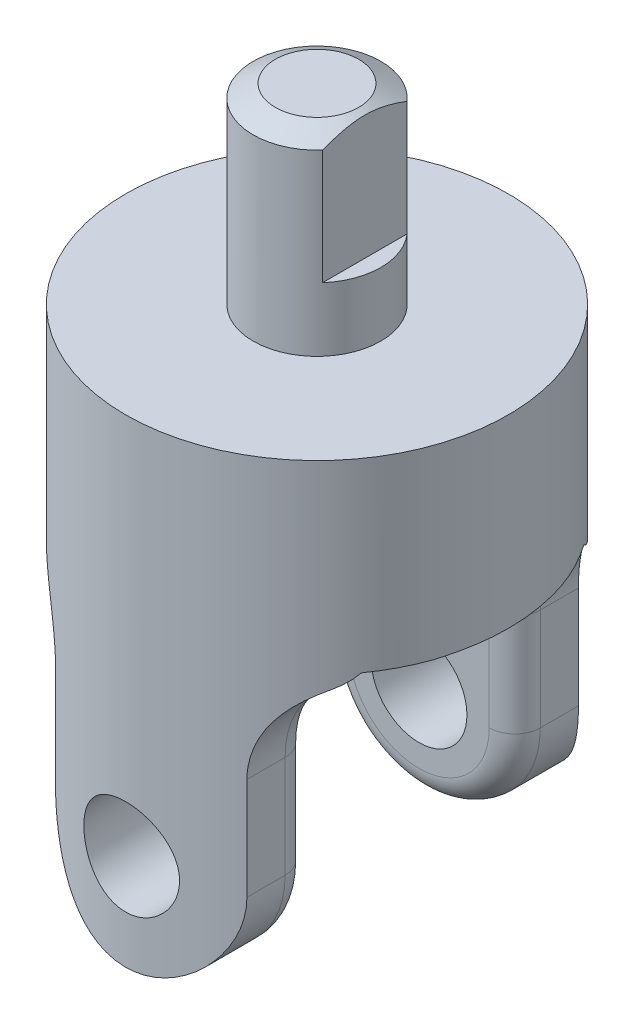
ISO-10303-21;
HEADER;
FILE_DESCRIPTION(('STEP AP214'),'2;1');
FILE_NAME('part.step','',(''),(''),'','','');
FILE_SCHEMA(('AUTOMOTIVE_DESIGN { 1 0 10303 214 1 1 1 1 }'));
ENDSEC;
DATA;
#1=APPLICATION_CONTEXT('core data for automotive mechanical design processes');
#2=APPLICATION_PROTOCOL_DEFINITION('international standard','automotive_design',2000,#1);
#3=PRODUCT_CONTEXT('',#1,'mechanical');
#4=PRODUCT('Part','Part','',(#3));
#5=PRODUCT_RELATED_PRODUCT_CATEGORY('part','',(#4));
#6=PRODUCT_DEFINITION_FORMATION('','',#4);
#7=PRODUCT_DEFINITION_CONTEXT('part definition',#1,'design');
#8=PRODUCT_DEFINITION('design','',#6,#7);
#9=PRODUCT_DEFINITION_SHAPE('','',#8);
#10=(LENGTH_UNIT() NAMED_UNIT(*) SI_UNIT(.MILLI.,.METRE.));
#11=(NAMED_UNIT(*) PLANE_ANGLE_UNIT() SI_UNIT($,.RADIAN.));
#12=(NAMED_UNIT(*) SI_UNIT($,.STERADIAN.) SOLID_ANGLE_UNIT());
#13=UNCERTAINTY_MEASURE_WITH_UNIT(LENGTH_MEASURE(1.E-05),#10,'distance_accuracy_value','');
#14=(GEOMETRIC_REPRESENTATION_CONTEXT(3) GLOBAL_UNCERTAINTY_ASSIGNED_CONTEXT((#13)) GLOBAL_UNIT_ASSIGNED_CONTEXT((#10,
#11,#12)) REPRESENTATION_CONTEXT('',''));
#15=CARTESIAN_POINT('',(0.,0.,0.));
#16=DIRECTION('',(0.,0.,1.));
#17=DIRECTION('',(1.,0.,0.));
#18=AXIS2_PLACEMENT_3D('',#15,#16,#17);
#19=CARTESIAN_POINT('',(0.,66.675,0.));
#20=DIRECTION('',(0.,-1.,0.));
#21=DIRECTION('',(0.,0.,-1.));
#22=AXIS2_PLACEMENT_3D('',#19,#20,#21);
#23=CYLINDRICAL_SURFACE('',#22,6.35);
#24=CARTESIAN_POINT('',(0.,47.625,0.));
#25=DIRECTION('',(0.,1.,0.));
#26=DIRECTION('',(0.,0.,1.));
#27=AXIS2_PLACEMENT_3D('',#24,#25,#26);
#28=CIRCLE('',#27,6.35);
#29=CARTESIAN_POINT('',(0.,47.625,6.35));
#30=VERTEX_POINT('',#29);
#31=EDGE_CURVE('E205',#30,#30,#28,.T.);
#32=ORIENTED_EDGE('',*,*,#31,.T.);
#33=EDGE_LOOP('',(#32));
#34=FACE_BOUND('',#33,.T.);
#35=DIRECTION('',(0.,1.,0.));
#36=VECTOR('',#35,1.);
#37=CARTESIAN_POINT('',(4.7625,53.975,4.20013020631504));
#38=LINE('',#37,#36);
#39=CARTESIAN_POINT('',(4.7625,53.975,4.20013020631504));
#40=VERTEX_POINT('',#39);
#41=CARTESIAN_POINT('',(4.7625,65.405,4.20013020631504));
#42=VERTEX_POINT('',#41);
#43=EDGE_CURVE('E192',#40,#42,#38,.T.);
#44=ORIENTED_EDGE('',*,*,#43,.T.);
#45=CARTESIAN_POINT('',(0.,65.405,0.));
#46=DIRECTION('',(0.,1.,0.));
#47=DIRECTION('',(0.,0.,1.));
#48=AXIS2_PLACEMENT_3D('',#45,#46,#47);
#49=CIRCLE('',#48,6.35);
#50=CARTESIAN_POINT('',(4.7625,65.405,-4.20013020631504));
#51=VERTEX_POINT('',#50);
#52=EDGE_CURVE('E203',#42,#51,#49,.F.);
#53=ORIENTED_EDGE('',*,*,#52,.T.);
#54=DIRECTION('',(0.,1.,0.));
#55=VECTOR('',#54,1.);
#56=CARTESIAN_POINT('',(4.7625,53.975,-4.20013020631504));
#57=LINE('',#56,#55);
#58=CARTESIAN_POINT('',(4.7625,53.975,-4.20013020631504));
#59=VERTEX_POINT('',#58);
#60=EDGE_CURVE('E189',#59,#51,#57,.T.);
#61=ORIENTED_EDGE('',*,*,#60,.F.);
#62=CARTESIAN_POINT('',(0.,53.975,0.));
#63=DIRECTION('',(0.,1.,0.));
#64=DIRECTION('',(0.,0.,1.));
#65=AXIS2_PLACEMENT_3D('',#62,#63,#64);
#66=CIRCLE('',#65,6.35);
#67=EDGE_CURVE('E195',#40,#59,#66,.T.);
#68=ORIENTED_EDGE('',*,*,#67,.F.);
#69=EDGE_LOOP('',(#44,#53,#61,#68));
#70=FACE_BOUND('',#69,.T.);
#71=ADVANCED_FACE('F31',(#34,#70),#23,.T.);
#72=CARTESIAN_POINT('',(0.,66.675,0.));
#73=DIRECTION('',(0.,-1.,0.));
#74=DIRECTION('',(0.,0.,-1.));
#75=AXIS2_PLACEMENT_3D('',#72,#73,#74);
#76=CONICAL_SURFACE('',#75,4.15029547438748,1.0471975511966);
#77=CARTESIAN_POINT('',(0.,66.675,0.));
#78=DIRECTION('',(0.,1.,0.));
#79=DIRECTION('',(0.,0.,1.));
#80=AXIS2_PLACEMENT_3D('',#77,#78,#79);
#81=CIRCLE('',#80,4.15029547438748);
#82=CARTESIAN_POINT('',(0.,66.675,4.15029547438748));
#83=VERTEX_POINT('',#82);
#84=EDGE_CURVE('E378',#83,#83,#81,.T.);
#85=ORIENTED_EDGE('',*,*,#84,.F.);
#86=EDGE_LOOP('',(#85));
#87=FACE_BOUND('',#86,.T.);
#88=ORIENTED_EDGE('',*,*,#52,.F.);
#89=CARTESIAN_POINT('',(4.7625,63.3576640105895,-8.67474438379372));
#90=CARTESIAN_POINT('',(4.7625,63.469711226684,-8.45330719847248));
#91=CARTESIAN_POINT('',(4.7625,63.5810014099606,-8.23148237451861));
#92=CARTESIAN_POINT('',(4.7625,63.8016576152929,-7.7868546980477));
#93=CARTESIAN_POINT('',(4.7625,63.9110234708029,-7.56405176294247));
#94=CARTESIAN_POINT('',(4.7625,64.1277386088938,-7.11660713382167));
#95=CARTESIAN_POINT('',(4.7625,64.2350805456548,-6.89196187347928));
#96=CARTESIAN_POINT('',(4.7625,64.4468042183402,-6.4412857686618));
#97=CARTESIAN_POINT('',(4.7625,64.551186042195,-6.21525496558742));
#98=CARTESIAN_POINT('',(4.7625,64.761300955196,-5.75026984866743));
#99=CARTESIAN_POINT('',(4.7625,64.8668450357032,-5.51122979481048));
#100=CARTESIAN_POINT('',(4.7625,65.0726380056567,-5.03084667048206));
#101=CARTESIAN_POINT('',(4.7625,65.1728864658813,-4.7895034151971));
#102=CARTESIAN_POINT('',(4.7625,65.3663272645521,-4.30430471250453));
#103=CARTESIAN_POINT('',(4.7625,65.4595275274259,-4.06045244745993));
#104=CARTESIAN_POINT('',(4.7625,65.6367537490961,-3.56945984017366));
#105=CARTESIAN_POINT('',(4.7625,65.7207816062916,-3.32232019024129));
#106=CARTESIAN_POINT('',(4.7625,65.8759823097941,-2.82653408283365));
#107=CARTESIAN_POINT('',(4.7625,65.9472687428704,-2.57792372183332));
#108=CARTESIAN_POINT('',(4.7625,66.0743145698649,-2.07671605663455));
#109=CARTESIAN_POINT('',(4.7625,66.1300751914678,-1.82411906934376));
#110=CARTESIAN_POINT('',(4.7625,66.2212225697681,-1.31963718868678));
#111=CARTESIAN_POINT('',(4.7625,66.2569437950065,-1.06781500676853));
#112=CARTESIAN_POINT('',(4.7625,66.2938959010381,-0.688501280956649));
#113=CARTESIAN_POINT('',(4.7625,66.3034417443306,-0.561789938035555));
#114=CARTESIAN_POINT('',(4.7625,66.3167609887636,-0.308068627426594));
#115=CARTESIAN_POINT('',(4.7625,66.3205349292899,-0.181058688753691));
#116=CARTESIAN_POINT('',(4.7625,66.3223134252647,0.0905838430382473));
#117=CARTESIAN_POINT('',(4.7625,66.3194472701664,0.235222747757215));
#118=CARTESIAN_POINT('',(4.7625,66.3061907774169,0.524155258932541));
#119=CARTESIAN_POINT('',(4.7625,66.2958001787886,0.668448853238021));
#120=CARTESIAN_POINT('',(4.7625,66.2678495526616,0.956362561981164));
#121=CARTESIAN_POINT('',(4.7625,66.2502880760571,1.09998253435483));
#122=CARTESIAN_POINT('',(4.7625,66.2085467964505,1.38625029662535));
#123=CARTESIAN_POINT('',(4.7625,66.18436689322,1.52889807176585));
#124=CARTESIAN_POINT('',(4.7625,66.1293852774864,1.81654493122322));
#125=CARTESIAN_POINT('',(4.7625,66.0984351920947,1.96151543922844));
#126=CARTESIAN_POINT('',(4.7625,66.0310411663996,2.25016667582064));
#127=CARTESIAN_POINT('',(4.7625,65.9945971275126,2.39384738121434));
#128=CARTESIAN_POINT('',(4.7625,65.9169451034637,2.67992954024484));
#129=CARTESIAN_POINT('',(4.7625,65.8757364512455,2.82233081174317));
#130=CARTESIAN_POINT('',(4.7625,65.7892365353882,3.10586895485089));
#131=CARTESIAN_POINT('',(4.7625,65.7439455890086,3.24700592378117));
#132=CARTESIAN_POINT('',(4.7625,65.6406667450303,3.55563142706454));
#133=CARTESIAN_POINT('',(4.7625,65.5819291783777,3.72286847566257));
#134=CARTESIAN_POINT('',(4.7625,65.4603269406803,4.05584009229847));
#135=CARTESIAN_POINT('',(4.7625,65.3974619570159,4.22157454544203));
#136=CARTESIAN_POINT('',(4.7625,65.2037410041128,4.71688299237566));
#137=CARTESIAN_POINT('',(4.7625,65.0677927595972,5.04446416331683));
#138=CARTESIAN_POINT('',(4.7625,64.7863691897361,5.69594921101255));
#139=CARTESIAN_POINT('',(4.7625,64.6408818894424,6.01984784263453));
#140=CARTESIAN_POINT('',(4.7625,64.3432582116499,6.66450132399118));
#141=CARTESIAN_POINT('',(4.7625,64.1911228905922,6.98525666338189));
#142=CARTESIAN_POINT('',(4.7625,63.8813253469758,7.62580230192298));
#143=CARTESIAN_POINT('',(4.7625,63.7236419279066,7.9455823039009));
#144=CARTESIAN_POINT('',(4.7625,63.4046196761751,8.58332268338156));
#145=CARTESIAN_POINT('',(4.7625,63.2432807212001,8.90128299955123));
#146=CARTESIAN_POINT('',(4.7625,62.9179416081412,9.53554216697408));
#147=CARTESIAN_POINT('',(4.7625,62.7539434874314,9.85184206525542));
#148=CARTESIAN_POINT('',(4.7625,62.4237848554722,10.4833121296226));
#149=CARTESIAN_POINT('',(4.7625,62.257624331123,10.7984822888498));
#150=CARTESIAN_POINT('',(4.7625,61.8068664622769,11.6479048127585));
#151=CARTESIAN_POINT('',(4.7625,61.5206664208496,12.181306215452));
#152=CARTESIAN_POINT('',(4.7625,60.9448108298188,13.2463803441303));
#153=CARTESIAN_POINT('',(4.7625,60.6551545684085,13.7780526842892));
#154=CARTESIAN_POINT('',(4.7625,60.0757028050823,14.8358326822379));
#155=CARTESIAN_POINT('',(4.7625,59.7859267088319,15.3619509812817));
#156=CARTESIAN_POINT('',(4.7625,59.2046035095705,16.4130517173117));
#157=CARTESIAN_POINT('',(4.7625,58.9130568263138,16.9380343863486));
#158=CARTESIAN_POINT('',(4.7625,58.620879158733,17.4626628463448));
#159=B_SPLINE_CURVE_WITH_KNOTS('',3,(#89,#90,#91,#92,#93,#94,#95,#96,#97,#98,#99,#100,#101,#102,
#103,#104,#105,#106,#107,#108,#109,#110,#111,#112,#113,#114,#115,#116,#117,#118,#119,#120,#121,
#122,#123,#124,#125,#126,#127,#128,#129,#130,#131,#132,#133,#134,#135,#136,#137,#138,#139,#140,
#141,#142,#143,#144,#145,#146,#147,#148,#149,#150,#151,#152,#153,#154,#155,#156,#157,#158),
.UNSPECIFIED.,.F.,.F.,(4,2,2,2,2,2,2,2,2,2,2,2,2,2,2,2,2,2,2,2,2,2,2,2,2,2,2,2,2,2,2,2,2,2,4),
(0.,0.744518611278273,1.48910134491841,2.23600427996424,2.98288500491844,3.76674752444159,
4.5506734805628,5.33370452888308,6.11657320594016,6.89207080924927,7.66750707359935,
8.42958338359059,8.81068147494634,9.19174395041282,9.6255420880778,10.0593552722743,
10.4932561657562,10.927163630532,11.3717539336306,11.8163522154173,12.2610128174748,
12.7056388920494,13.2373268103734,13.7690550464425,14.8328219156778,15.8979507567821,
16.9629109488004,18.0325121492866,19.102149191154,20.1710021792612,21.2398616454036,
23.0558392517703,24.8721975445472,26.6741189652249,28.4756286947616),.UNSPECIFIED.);
#160=EDGE_CURVE('E384',#42,#51,#159,.F.);
#161=ORIENTED_EDGE('',*,*,#160,.T.);
#162=EDGE_LOOP('',(#88,#161));
#163=FACE_BOUND('',#162,.T.);
#164=ADVANCED_FACE('F318',(#87,#163),#76,.T.);
#165=CARTESIAN_POINT('',(0.,47.625,0.));
#166=DIRECTION('',(0.,1.,0.));
#167=DIRECTION('',(0.,0.,1.));
#168=AXIS2_PLACEMENT_3D('',#165,#166,#167);
#169=PLANE('',#168);
#170=CARTESIAN_POINT('',(0.,47.625,0.));
#171=DIRECTION('',(0.,1.,0.));
#172=DIRECTION('',(0.,0.,1.));
#173=AXIS2_PLACEMENT_3D('',#170,#171,#172);
#174=CIRCLE('',#173,19.05);
#175=CARTESIAN_POINT('',(0.,47.625,19.05));
#176=VERTEX_POINT('',#175);
#177=EDGE_CURVE('E413',#176,#176,#174,.T.);
#178=ORIENTED_EDGE('',*,*,#177,.T.);
#179=EDGE_LOOP('',(#178));
#180=FACE_BOUND('',#179,.T.);
#181=ORIENTED_EDGE('',*,*,#31,.F.);
#182=EDGE_LOOP('',(#181));
#183=FACE_BOUND('',#182,.T.);
#184=ADVANCED_FACE('F336',(#180,#183),#169,.T.);
#185=CARTESIAN_POINT('',(0.,47.625,0.));
#186=DIRECTION('',(0.,-1.,0.));
#187=DIRECTION('',(0.,0.,-1.));
#188=AXIS2_PLACEMENT_3D('',#185,#186,#187);
#189=CYLINDRICAL_SURFACE('',#188,19.05);
#190=CARTESIAN_POINT('',(0.,14.2875,-19.05));
#191=CARTESIAN_POINT('',(-0.263131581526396,14.2874926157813,-19.0499955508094));
#192=CARTESIAN_POINT('',(-0.526345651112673,14.2656193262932,-19.0444938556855));
#193=CARTESIAN_POINT('',(-1.04523007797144,14.1788351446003,-19.0230796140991));
#194=CARTESIAN_POINT('',(-1.3008960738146,14.1138998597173,-19.0071611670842));
#195=CARTESIAN_POINT('',(-1.79711626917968,13.9432053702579,-18.966676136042));
#196=CARTESIAN_POINT('',(-2.03768821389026,13.837495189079,-18.9421199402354));
#197=CARTESIAN_POINT('',(-2.49768401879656,13.5884240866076,-18.886974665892));
#198=CARTESIAN_POINT('',(-2.71710716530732,13.4450618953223,-18.8563853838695));
#199=CARTESIAN_POINT('',(-3.13309611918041,13.121637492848,-18.7917903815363));
#200=CARTESIAN_POINT('',(-3.32916431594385,12.940945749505,-18.757731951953));
#201=CARTESIAN_POINT('',(-3.68855284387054,12.5493392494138,-18.6903874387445));
#202=CARTESIAN_POINT('',(-3.85186947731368,12.3384210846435,-18.6571014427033));
#203=CARTESIAN_POINT('',(-4.14345927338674,11.8884851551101,-18.5945391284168));
#204=CARTESIAN_POINT('',(-4.27117578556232,11.6490964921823,-18.5653297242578));
#205=CARTESIAN_POINT('',(-4.48436018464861,11.1513987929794,-18.514996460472));
#206=CARTESIAN_POINT('',(-4.56983482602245,10.8930927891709,-18.4938713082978));
#207=CARTESIAN_POINT('',(-4.69441160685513,10.3703643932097,-18.4626401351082));
#208=CARTESIAN_POINT('',(-4.73440845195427,10.1061682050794,-18.4523218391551));
#209=CARTESIAN_POINT('',(-4.76968113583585,9.57462979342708,-18.443237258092));
#210=CARTESIAN_POINT('',(-4.7649642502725,9.30728808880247,-18.4444690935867));
#211=CARTESIAN_POINT('',(-4.71165721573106,8.78390481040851,-18.4581547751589));
#212=CARTESIAN_POINT('',(-4.66413323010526,8.52774640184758,-18.4703359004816));
#213=CARTESIAN_POINT('',(-4.528261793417,8.02715866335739,-18.5041130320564));
#214=CARTESIAN_POINT('',(-4.43991143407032,7.78273017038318,-18.5257097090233));
#215=CARTESIAN_POINT('',(-4.22398659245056,7.30968179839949,-18.5761348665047));
#216=CARTESIAN_POINT('',(-4.09602516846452,7.08124640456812,-18.6050341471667));
#217=CARTESIAN_POINT('',(-3.80478117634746,6.6487080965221,-18.6667683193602));
#218=CARTESIAN_POINT('',(-3.64149242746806,6.44460944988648,-18.6996038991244));
#219=CARTESIAN_POINT('',(-3.27870637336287,6.06042852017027,-18.7666592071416));
#220=CARTESIAN_POINT('',(-3.07830936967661,5.88119699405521,-18.8008917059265));
#221=CARTESIAN_POINT('',(-2.64989283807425,5.55872255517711,-18.8660394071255));
#222=CARTESIAN_POINT('',(-2.42187246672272,5.41548074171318,-18.8969545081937));
#223=CARTESIAN_POINT('',(-1.94346794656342,5.16873938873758,-18.9521379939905));
#224=CARTESIAN_POINT('',(-1.69300967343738,5.06537804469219,-18.9763831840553));
#225=CARTESIAN_POINT('',(-1.17753132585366,4.90246255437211,-19.0153263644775));
#226=CARTESIAN_POINT('',(-0.912514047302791,4.84290002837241,-19.0300261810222));
#227=CARTESIAN_POINT('',(-0.382714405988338,4.77057222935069,-19.0479521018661));
#228=CARTESIAN_POINT('',(-0.11809958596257,4.75664839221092,-19.0514621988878));
#229=CARTESIAN_POINT('',(0.409679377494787,4.77281558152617,-19.0474220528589));
#230=CARTESIAN_POINT('',(0.672843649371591,4.80290264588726,-19.0398728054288));
#231=CARTESIAN_POINT('',(1.18622530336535,4.90528263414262,-19.0147442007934));
#232=CARTESIAN_POINT('',(1.43657675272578,4.97694351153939,-18.9973151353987));
#233=CARTESIAN_POINT('',(1.92169190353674,5.15971499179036,-18.9543914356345));
#234=CARTESIAN_POINT('',(2.15645402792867,5.27082957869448,-18.928895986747));
#235=CARTESIAN_POINT('',(2.60833595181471,5.5315997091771,-18.8719875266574));
#236=CARTESIAN_POINT('',(2.82506877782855,5.6819041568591,-18.8404775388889));
#237=CARTESIAN_POINT('',(3.23064699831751,6.015957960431,-18.7751881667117));
#238=CARTESIAN_POINT('',(3.41948756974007,6.19971308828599,-18.7414083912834));
#239=CARTESIAN_POINT('',(3.76869505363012,6.60083122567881,-18.6743643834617));
#240=CARTESIAN_POINT('',(3.92824927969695,6.81890845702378,-18.6411331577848));
#241=CARTESIAN_POINT('',(4.20849665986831,7.27942611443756,-18.5798738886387));
#242=CARTESIAN_POINT('',(4.32919153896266,7.5218654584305,-18.5518456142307));
#243=CARTESIAN_POINT('',(4.5273957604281,8.02292566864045,-18.5044745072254));
#244=CARTESIAN_POINT('',(4.60516095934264,8.28144021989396,-18.4850803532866));
#245=CARTESIAN_POINT('',(4.71597247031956,8.80843310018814,-18.457124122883));
#246=CARTESIAN_POINT('',(4.7490285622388,9.0769092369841,-18.4485596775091));
#247=CARTESIAN_POINT('',(4.76897252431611,9.60793425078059,-18.4434131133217));
#248=CARTESIAN_POINT('',(4.75715932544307,9.87043185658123,-18.4464938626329));
#249=CARTESIAN_POINT('',(4.69067285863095,10.3895648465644,-18.4635111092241));
#250=CARTESIAN_POINT('',(4.63600045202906,10.6462003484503,-18.4774473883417));
#251=CARTESIAN_POINT('',(4.48605693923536,11.1449118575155,-18.5144175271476));
#252=CARTESIAN_POINT('',(4.3910294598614,11.3870654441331,-18.5373967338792));
#253=CARTESIAN_POINT('',(4.1632661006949,11.8521650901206,-18.5898712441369));
#254=CARTESIAN_POINT('',(4.03052499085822,12.0751084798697,-18.6193674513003));
#255=CARTESIAN_POINT('',(3.72703010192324,12.5017359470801,-18.6825138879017));
#256=CARTESIAN_POINT('',(3.5553750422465,12.7047659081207,-18.7162524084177));
#257=CARTESIAN_POINT('',(3.18068125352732,13.0795618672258,-18.7835548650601));
#258=CARTESIAN_POINT('',(2.97763508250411,13.2513204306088,-18.8171187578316));
#259=CARTESIAN_POINT('',(2.54148458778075,13.5617309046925,-18.8810155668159));
#260=CARTESIAN_POINT('',(2.30790249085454,13.6997268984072,-18.911278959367));
#261=CARTESIAN_POINT('',(1.82011973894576,13.9342731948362,-18.9644313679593));
#262=CARTESIAN_POINT('',(1.56593401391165,14.0308531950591,-18.9873256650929));
#263=CARTESIAN_POINT('',(1.09350255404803,14.1654905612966,-19.0197758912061));
#264=CARTESIAN_POINT('',(0.877507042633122,14.2111451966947,-19.031032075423));
#265=CARTESIAN_POINT('',(0.441026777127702,14.2721518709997,-19.0461457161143));
#266=CARTESIAN_POINT('',(0.220542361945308,14.2875061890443,-19.0500037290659));
#267=CARTESIAN_POINT('',(0.,14.2875,-19.05));
#268=B_SPLINE_CURVE_WITH_KNOTS('',3,(#190,#191,#192,#193,#194,#195,#196,#197,#198,#199,#200,
#201,#202,#203,#204,#205,#206,#207,#208,#209,#210,#211,#212,#213,#214,#215,#216,#217,#218,#219,
#220,#221,#222,#223,#224,#225,#226,#227,#228,#229,#230,#231,#232,#233,#234,#235,#236,#237,#238,
#239,#240,#241,#242,#243,#244,#245,#246,#247,#248,#249,#250,#251,#252,#253,#254,#255,#256,#257,
#258,#259,#260,#261,#262,#263,#264,#265,#266,#267),.UNSPECIFIED.,.T.,.F.,(4,2,2,2,2,2,2,2,2,2,2,
2,2,2,2,2,2,2,2,2,2,2,2,2,2,2,2,2,2,2,2,2,2,2,2,2,2,2,4),(0.,0.78858653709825,1.57762015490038,
2.36570806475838,3.15382256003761,3.95650832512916,4.75928466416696,5.57398705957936,
6.38855914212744,7.18681236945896,7.98493571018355,8.76371428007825,9.54254833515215,
10.3292442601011,11.1160779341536,11.9253476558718,12.7346420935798,13.5467162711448,
14.3586350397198,15.1497763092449,15.940846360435,16.7201937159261,17.4996197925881,
18.2928764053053,19.08627002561,19.8991381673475,20.7119702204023,21.5199040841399,
22.3276611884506,23.1122150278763,23.8967531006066,24.6766207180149,25.4565965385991,
26.2569190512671,27.0574315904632,27.8724418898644,28.6868668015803,29.3478662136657,
30.008815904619),.UNSPECIFIED.);
#269=CARTESIAN_POINT('',(0.,14.2875,-19.05));
#270=VERTEX_POINT('',#269);
#271=EDGE_CURVE('E221',#270,#270,#268,.T.);
#272=ORIENTED_EDGE('',*,*,#271,.T.);
#273=EDGE_LOOP('',(#272));
#274=FACE_BOUND('',#273,.T.);
#275=CARTESIAN_POINT('',(4.7625,9.525,18.4450831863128));
#276=CARTESIAN_POINT('',(4.7624925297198,9.26201331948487,18.4450882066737));
#277=CARTESIAN_POINT('',(4.74064249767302,8.99894396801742,18.4507690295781));
#278=CARTESIAN_POINT('',(4.65395905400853,8.48035976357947,18.4728204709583));
#279=CARTESIAN_POINT('',(4.58910062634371,8.22484939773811,18.4891973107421));
#280=CARTESIAN_POINT('',(4.41863073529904,7.72895925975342,18.5306727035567));
#281=CARTESIAN_POINT('',(4.31307188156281,7.48856041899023,18.5557599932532));
#282=CARTESIAN_POINT('',(4.06435777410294,7.02885782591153,18.6118155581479));
#283=CARTESIAN_POINT('',(3.92120092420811,6.80955496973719,18.6427840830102));
#284=CARTESIAN_POINT('',(3.59798955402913,6.39344356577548,18.7078756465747));
#285=CARTESIAN_POINT('',(3.41725927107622,6.19716769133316,18.7420490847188));
#286=CARTESIAN_POINT('',(3.02548683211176,5.83737454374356,18.8092627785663));
#287=CARTESIAN_POINT('',(2.81444184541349,5.67386033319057,18.8423029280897));
#288=CARTESIAN_POINT('',(2.36438160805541,5.38205273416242,18.9040849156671));
#289=CARTESIAN_POINT('',(2.12501716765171,5.25428263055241,18.9327603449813));
#290=CARTESIAN_POINT('',(1.62737136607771,5.04099262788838,18.98200696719));
#291=CARTESIAN_POINT('',(1.36909280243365,4.95546649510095,19.0025793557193));
#292=CARTESIAN_POINT('',(0.846503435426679,4.8307983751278,19.0329456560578));
#293=CARTESIAN_POINT('',(0.582420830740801,4.79075182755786,19.0429494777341));
#294=CARTESIAN_POINT('',(0.0511089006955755,4.75534028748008,19.0517829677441));
#295=CARTESIAN_POINT('',(-0.216119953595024,4.75996868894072,19.0506142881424));
#296=CARTESIAN_POINT('',(-0.739865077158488,4.81312508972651,19.0373907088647));
#297=CARTESIAN_POINT('',(-0.996487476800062,4.86067669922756,19.0255779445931));
#298=CARTESIAN_POINT('',(-1.4979884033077,4.99676026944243,18.992675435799));
#299=CARTESIAN_POINT('',(-1.74286630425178,5.08529441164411,18.9715851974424));
#300=CARTESIAN_POINT('',(-2.21649942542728,5.30161989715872,18.9221270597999));
#301=CARTESIAN_POINT('',(-2.44508897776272,5.42975872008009,18.8936951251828));
#302=CARTESIAN_POINT('',(-2.87786265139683,5.72139256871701,18.8326376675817));
#303=CARTESIAN_POINT('',(-3.08204251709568,5.88489374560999,18.8000114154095));
#304=CARTESIAN_POINT('',(-3.46602384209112,6.24784515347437,18.733078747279));
#305=CARTESIAN_POINT('',(-3.64501594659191,6.44814856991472,18.6987507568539));
#306=CARTESIAN_POINT('',(-3.96704999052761,6.87628794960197,18.6330915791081));
#307=CARTESIAN_POINT('',(-4.11009024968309,7.10412519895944,18.6017605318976));
#308=CARTESIAN_POINT('',(-4.35667846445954,7.58245251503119,18.5455654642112));
#309=CARTESIAN_POINT('',(-4.46003156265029,7.8330470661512,18.5207335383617));
#310=CARTESIAN_POINT('',(-4.6228902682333,8.34882531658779,18.4807600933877));
#311=CARTESIAN_POINT('',(-4.68240525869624,8.61400588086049,18.4656165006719));
#312=CARTESIAN_POINT('',(-4.75455546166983,9.14392285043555,18.4471695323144));
#313=CARTESIAN_POINT('',(-4.76838735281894,9.40848599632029,18.4435639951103));
#314=CARTESIAN_POINT('',(-4.75205486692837,9.93614078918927,18.4477788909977));
#315=CARTESIAN_POINT('',(-4.72189453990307,10.1992325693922,18.4555982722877));
#316=CARTESIAN_POINT('',(-4.61948300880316,10.7120326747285,18.4814924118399));
#317=CARTESIAN_POINT('',(-4.54792855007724,10.9618895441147,18.4993972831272));
#318=CARTESIAN_POINT('',(-4.36553244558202,11.4460619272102,18.5432836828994));
#319=CARTESIAN_POINT('',(-4.25468614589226,11.6803755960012,18.5692661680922));
#320=CARTESIAN_POINT('',(-3.99434812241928,12.1318806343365,18.6270164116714));
#321=CARTESIAN_POINT('',(-3.84414094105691,12.3486459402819,18.6588876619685));
#322=CARTESIAN_POINT('',(-3.51024964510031,12.7543338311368,18.7245704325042));
#323=CARTESIAN_POINT('',(-3.3265600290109,12.9432518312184,18.7583822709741));
#324=CARTESIAN_POINT('',(-2.92542620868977,13.2927300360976,18.8251605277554));
#325=CARTESIAN_POINT('',(-2.70725242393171,13.4524624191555,18.8580846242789));
#326=CARTESIAN_POINT('',(-2.24648402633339,13.7330228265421,18.9185019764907));
#327=CARTESIAN_POINT('',(-2.00389068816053,13.8538528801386,18.9459955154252));
#328=CARTESIAN_POINT('',(-1.50284593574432,14.0521296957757,18.9922807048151));
#329=CARTESIAN_POINT('',(-1.24452402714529,14.1298884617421,19.0111347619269));
#330=CARTESIAN_POINT('',(-0.717945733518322,14.240751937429,19.0382898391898));
#331=CARTESIAN_POINT('',(-0.449691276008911,14.2738652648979,19.0465928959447));
#332=CARTESIAN_POINT('',(0.0813602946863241,14.2940131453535,19.0516273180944));
#333=CARTESIAN_POINT('',(0.344108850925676,14.2822693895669,19.0486654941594));
#334=CARTESIAN_POINT('',(0.863762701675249,14.2158347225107,19.0321833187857));
#335=CARTESIAN_POINT('',(1.12066816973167,14.1611450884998,19.0186632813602));
#336=CARTESIAN_POINT('',(1.62006455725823,14.0110263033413,18.9826312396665));
#337=CARTESIAN_POINT('',(1.86262563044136,13.9158180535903,18.9601680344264));
#338=CARTESIAN_POINT('',(2.32846746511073,13.6875651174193,18.908615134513));
#339=CARTESIAN_POINT('',(2.55174579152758,13.5545156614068,18.8795246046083));
#340=CARTESIAN_POINT('',(2.97847668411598,13.2506311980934,18.8169827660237));
#341=CARTESIAN_POINT('',(3.18132613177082,13.0789673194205,18.7834436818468));
#342=CARTESIAN_POINT('',(3.55575403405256,12.7043361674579,18.7161796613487));
#343=CARTESIAN_POINT('',(3.72732454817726,12.5013609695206,18.6824546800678));
#344=CARTESIAN_POINT('',(4.0374666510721,12.0653107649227,18.6179210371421));
#345=CARTESIAN_POINT('',(4.1753628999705,11.831744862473,18.5871785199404));
#346=CARTESIAN_POINT('',(4.4097268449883,11.3440107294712,18.5329808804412));
#347=CARTESIAN_POINT('',(4.50622468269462,11.0898576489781,18.5095204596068));
#348=CARTESIAN_POINT('',(4.6406872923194,10.6176269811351,18.4762096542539));
#349=CARTESIAN_POINT('',(4.68626747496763,10.401808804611,18.4646250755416));
#350=CARTESIAN_POINT('',(4.74717566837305,9.96567951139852,18.4490600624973));
#351=CARTESIAN_POINT('',(4.76250625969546,9.74536877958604,18.4450789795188));
#352=CARTESIAN_POINT('',(4.7625,9.525,18.4450831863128));
#353=B_SPLINE_CURVE_WITH_KNOTS('',3,(#275,#276,#277,#278,#279,#280,#281,#282,#283,#284,#285,
#286,#287,#288,#289,#290,#291,#292,#293,#294,#295,#296,#297,#298,#299,#300,#301,#302,#303,#304,
#305,#306,#307,#308,#309,#310,#311,#312,#313,#314,#315,#316,#317,#318,#319,#320,#321,#322,#323,
#324,#325,#326,#327,#328,#329,#330,#331,#332,#333,#334,#335,#336,#337,#338,#339,#340,#341,#342,
#343,#344,#345,#346,#347,#348,#349,#350,#351,#352),.UNSPECIFIED.,.T.,.F.,(4,2,2,2,2,2,2,2,2,2,2,
2,2,2,2,2,2,2,2,2,2,2,2,2,2,2,2,2,2,2,2,2,2,2,2,2,2,2,4),(0.,0.788150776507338,1.57676038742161,
2.36435403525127,3.15198112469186,3.95523632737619,4.75856658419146,5.57310600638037,
6.3875251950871,7.18544570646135,7.98324823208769,8.76334790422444,9.54348910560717,
10.3306792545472,11.1180064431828,11.9266423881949,12.7353161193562,13.5479110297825,
14.3603319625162,15.1512950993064,15.9421854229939,16.7201355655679,17.4981778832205,
18.2914832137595,19.0849190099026,19.8982075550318,20.7114536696,21.5187289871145,
22.3258484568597,23.1111446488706,23.896417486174,24.677462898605,25.4586067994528,
26.258464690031,27.0585253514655,27.8735118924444,28.6879040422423,29.3483886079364,
30.0088168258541),.UNSPECIFIED.);
#354=CARTESIAN_POINT('',(4.7625,9.525,18.4450831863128));
#355=VERTEX_POINT('',#354);
#356=EDGE_CURVE('E214',#355,#355,#353,.T.);
#357=ORIENTED_EDGE('',*,*,#356,.T.);
#358=EDGE_LOOP('',(#357));
#359=FACE_BOUND('',#358,.T.);
#360=ORIENTED_EDGE('',*,*,#177,.F.);
#361=EDGE_LOOP('',(#360));
#362=FACE_BOUND('',#361,.T.);
#363=CARTESIAN_POINT('',(0.,29.1452388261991,0.));
#364=DIRECTION('',(0.,1.,0.));
#365=DIRECTION('',(0.,0.,1.));
#366=AXIS2_PLACEMENT_3D('',#363,#364,#365);
#367=CIRCLE('',#366,19.05);
#368=CARTESIAN_POINT('',(-17.9411689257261,29.1452388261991,6.40444826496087));
#369=VERTEX_POINT('',#368);
#370=CARTESIAN_POINT('',(-15.4943364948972,29.1452388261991,11.0827810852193));
#371=VERTEX_POINT('',#370);
#372=EDGE_CURVE('E415',#369,#371,#367,.T.);
#373=ORIENTED_EDGE('',*,*,#372,.T.);
#374=CARTESIAN_POINT('',(-15.4943364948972,29.1452388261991,11.0827810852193));
#375=CARTESIAN_POINT('',(-15.4603741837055,29.0905949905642,11.1302640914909));
#376=CARTESIAN_POINT('',(-15.4254074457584,29.0374234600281,11.1786861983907));
#377=CARTESIAN_POINT('',(-15.3535947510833,28.9339301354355,11.2771153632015));
#378=CARTESIAN_POINT('',(-15.3167494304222,28.8836073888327,11.3271218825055));
#379=CARTESIAN_POINT('',(-15.2036555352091,28.7368475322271,11.4789919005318));
#380=CARTESIAN_POINT('',(-15.1247575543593,28.6444732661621,11.5828343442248));
#381=CARTESIAN_POINT('',(-14.9617748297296,28.4709223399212,11.7925923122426));
#382=CARTESIAN_POINT('',(-14.8777684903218,28.3896186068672,11.8984648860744));
#383=CARTESIAN_POINT('',(-14.7042203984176,28.2361548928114,12.1122813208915));
#384=CARTESIAN_POINT('',(-14.6146784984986,28.163995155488,12.2202252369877));
#385=CARTESIAN_POINT('',(-14.4703734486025,28.0577974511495,12.3902102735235));
#386=CARTESIAN_POINT('',(-14.417341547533,28.0207832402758,12.4518864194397));
#387=CARTESIAN_POINT('',(-14.309482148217,27.9494298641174,12.5756903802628));
#388=CARTESIAN_POINT('',(-14.2546487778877,27.9151010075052,12.6378190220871));
#389=CARTESIAN_POINT('',(-14.1990316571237,27.8821782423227,12.6999999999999));
#390=B_SPLINE_CURVE_WITH_KNOTS('',3,(#374,#375,#376,#377,#378,#379,#380,#381,#382,#383,#384,
#385,#386,#387,#388,#389),.UNSPECIFIED.,.F.,.F.,(4,2,2,2,2,2,2,4),(0.,0.239826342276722,
0.479572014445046,0.958421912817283,1.43120327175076,1.90399722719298,2.17204568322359,
2.44107721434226),.UNSPECIFIED.);
#391=CARTESIAN_POINT('',(-14.1990316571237,27.8821782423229,12.7));
#392=VERTEX_POINT('',#391);
#393=EDGE_CURVE('E305',#371,#392,#390,.T.);
#394=ORIENTED_EDGE('',*,*,#393,.T.);
#395=CARTESIAN_POINT('',(-9.525,19.685,-16.4977839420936));
#396=CARTESIAN_POINT('',(-9.52496088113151,19.918350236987,-16.4977688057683));
#397=CARTESIAN_POINT('',(-9.53357353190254,20.1516967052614,-16.4928328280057));
#398=CARTESIAN_POINT('',(-9.56782146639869,20.6166980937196,-16.4730087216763));
#399=CARTESIAN_POINT('',(-9.59345572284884,20.8483531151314,-16.4581211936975));
#400=CARTESIAN_POINT('',(-9.66141942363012,21.3080009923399,-16.4183108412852));
#401=CARTESIAN_POINT('',(-9.70372594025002,21.5359984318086,-16.3934017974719));
#402=CARTESIAN_POINT('',(-9.80447669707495,21.9870210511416,-16.3333461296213));
#403=CARTESIAN_POINT('',(-9.86292069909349,22.2100463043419,-16.2981996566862));
#404=CARTESIAN_POINT('',(-9.99521577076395,22.6496636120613,-16.217402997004));
#405=CARTESIAN_POINT('',(-10.0690752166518,22.8662520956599,-16.1717470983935));
#406=CARTESIAN_POINT('',(-10.2311827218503,23.2913603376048,-16.0696785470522));
#407=CARTESIAN_POINT('',(-10.3194309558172,23.4998799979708,-16.0132657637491));
#408=CARTESIAN_POINT('',(-10.5090589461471,23.9073731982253,-15.8894615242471));
#409=CARTESIAN_POINT('',(-10.6104339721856,24.1063501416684,-15.8220740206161));
#410=CARTESIAN_POINT('',(-10.8249101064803,24.4935871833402,-15.676116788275));
#411=CARTESIAN_POINT('',(-10.9380111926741,24.6818473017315,-15.597547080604));
#412=CARTESIAN_POINT('',(-11.1750060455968,25.0476354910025,-15.4286429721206));
#413=CARTESIAN_POINT('',(-11.2989577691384,25.2250961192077,-15.3382439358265));
#414=CARTESIAN_POINT('',(-11.5553164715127,25.5672655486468,-15.1460495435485));
#415=CARTESIAN_POINT('',(-11.6877234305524,25.7319743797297,-15.0442542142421));
#416=CARTESIAN_POINT('',(-11.9591574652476,26.0480960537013,-14.8293967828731));
#417=CARTESIAN_POINT('',(-12.0981857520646,26.1995064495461,-14.7163326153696));
#418=CARTESIAN_POINT('',(-12.3809708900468,26.4887188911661,-14.4792302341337));
#419=CARTESIAN_POINT('',(-12.5247282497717,26.6265194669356,-14.3551908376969));
#420=CARTESIAN_POINT('',(-12.8240785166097,26.8965620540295,-14.0885806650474));
#421=CARTESIAN_POINT('',(-12.9798547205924,27.0279377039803,-13.9453388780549));
#422=CARTESIAN_POINT('',(-13.292575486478,27.2756182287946,-13.6475843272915));
#423=CARTESIAN_POINT('',(-13.4495200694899,27.3919228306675,-13.4930713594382));
#424=CARTESIAN_POINT('',(-13.7627279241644,27.6100750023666,-13.1734537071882));
#425=CARTESIAN_POINT('',(-13.91899104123,27.7119194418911,-13.0083467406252));
#426=CARTESIAN_POINT('',(-14.2291584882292,27.9019462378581,-12.6683290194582));
#427=CARTESIAN_POINT('',(-14.3830623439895,27.9901258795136,-12.4934163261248));
#428=CARTESIAN_POINT('',(-14.7634251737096,28.1948863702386,-12.0444336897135));
#429=CARTESIAN_POINT('',(-14.9875078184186,28.3034922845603,-11.7646791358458));
#430=CARTESIAN_POINT('',(-15.4232003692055,28.4957157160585,-11.1874194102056));
#431=CARTESIAN_POINT('',(-15.6348051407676,28.5793230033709,-10.8899070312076));
#432=CARTESIAN_POINT('',(-16.0431146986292,28.7255421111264,-10.2789237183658));
#433=CARTESIAN_POINT('',(-16.2397846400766,28.7881059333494,-9.96541815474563));
#434=CARTESIAN_POINT('',(-16.615638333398,28.8957388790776,-9.3252837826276));
#435=CARTESIAN_POINT('',(-16.7948218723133,28.9408077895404,-8.99865481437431));
#436=CARTESIAN_POINT('',(-17.1918461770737,29.029905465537,-8.22145899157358));
#437=CARTESIAN_POINT('',(-17.4021973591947,29.0684013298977,-7.76641658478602));
#438=CARTESIAN_POINT('',(-17.786699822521,29.1278564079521,-6.8401406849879));
#439=CARTESIAN_POINT('',(-17.9608394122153,29.1488099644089,-6.36890201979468));
#440=CARTESIAN_POINT('',(-18.2714417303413,29.1794105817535,-5.41378881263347));
#441=CARTESIAN_POINT('',(-18.4079009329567,29.1890565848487,-4.92991309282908));
#442=CARTESIAN_POINT('',(-18.6421466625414,29.2019870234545,-3.95287775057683));
#443=CARTESIAN_POINT('',(-18.7399368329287,29.2052720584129,-3.45971900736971));
#444=CARTESIAN_POINT('',(-18.897358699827,29.2091078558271,-2.4600813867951));
#445=CARTESIAN_POINT('',(-18.9564226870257,29.2096187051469,-1.95351291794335));
#446=CARTESIAN_POINT('',(-19.033752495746,29.2100647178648,-0.937263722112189));
#447=CARTESIAN_POINT('',(-19.0520174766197,29.209999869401,-0.42758293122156));
#448=CARTESIAN_POINT('',(-19.0476285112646,29.2100001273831,0.591825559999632));
#449=CARTESIAN_POINT('',(-19.0249568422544,29.2100652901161,1.10155318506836));
#450=CARTESIAN_POINT('',(-18.9388075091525,29.2094475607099,2.11754548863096));
#451=CARTESIAN_POINT('',(-18.8753295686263,29.2087646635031,2.6238101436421));
#452=CARTESIAN_POINT('',(-18.7036160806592,29.2041086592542,3.65580332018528));
#453=CARTESIAN_POINT('',(-18.5932233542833,29.1999661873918,4.18117378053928));
#454=CARTESIAN_POINT('',(-18.3285057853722,29.1835599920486,5.22073652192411));
#455=CARTESIAN_POINT('',(-18.1741722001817,29.1712946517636,5.73492655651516));
#456=CARTESIAN_POINT('',(-17.8230306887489,29.1322930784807,6.7475164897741));
#457=CARTESIAN_POINT('',(-17.6262637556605,29.1055707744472,7.24593109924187));
#458=CARTESIAN_POINT('',(-17.1921907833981,29.0296619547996,8.2229157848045));
#459=CARTESIAN_POINT('',(-16.9549063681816,28.9804873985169,8.70149627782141));
#460=CARTESIAN_POINT('',(-16.5317482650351,28.8726944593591,9.47232063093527));
#461=CARTESIAN_POINT('',(-16.356505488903,28.8232353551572,9.7717274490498));
#462=CARTESIAN_POINT('',(-15.9915321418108,28.7076409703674,10.3582119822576));
#463=CARTESIAN_POINT('',(-15.8018055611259,28.6415102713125,10.6452930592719));
#464=CARTESIAN_POINT('',(-15.4100602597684,28.4895738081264,11.2048655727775));
#465=CARTESIAN_POINT('',(-15.2080616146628,28.4037995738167,11.4773795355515));
#466=CARTESIAN_POINT('',(-14.794100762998,28.2093882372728,12.0062371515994));
#467=CARTESIAN_POINT('',(-14.5821407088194,28.1007560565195,12.2625842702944));
#468=CARTESIAN_POINT('',(-14.1961331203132,27.8828084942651,12.7059055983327));
#469=CARTESIAN_POINT('',(-14.0232896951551,27.7782615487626,12.8962780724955));
#470=CARTESIAN_POINT('',(-13.6756323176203,27.5516907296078,13.2643740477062));
#471=CARTESIAN_POINT('',(-13.5008188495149,27.4296710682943,13.4421005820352));
#472=CARTESIAN_POINT('',(-13.1516762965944,27.1671845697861,13.7838888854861));
#473=CARTESIAN_POINT('',(-12.9773471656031,27.0267195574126,13.947952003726));
#474=CARTESIAN_POINT('',(-12.6319391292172,26.726763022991,14.2615225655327));
#475=CARTESIAN_POINT('',(-12.4608602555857,26.5672713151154,14.4110298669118));
#476=CARTESIAN_POINT('',(-12.1237135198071,26.2279198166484,14.6958204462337));
#477=CARTESIAN_POINT('',(-11.9576926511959,26.0479167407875,14.8309890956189));
#478=CARTESIAN_POINT('',(-11.6351953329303,25.6689938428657,15.0853214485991));
#479=CARTESIAN_POINT('',(-11.4787191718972,25.4700734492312,15.2044846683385));
#480=CARTESIAN_POINT('',(-11.1784747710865,25.0543983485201,15.4265708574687));
#481=CARTESIAN_POINT('',(-11.0347050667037,24.8376457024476,15.5294956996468));
#482=CARTESIAN_POINT('',(-10.7628059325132,24.3878782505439,15.7191604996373));
#483=CARTESIAN_POINT('',(-10.6346741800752,24.154865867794,15.8059028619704));
#484=CARTESIAN_POINT('',(-10.4115375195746,23.7046522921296,15.9536199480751));
#485=CARTESIAN_POINT('',(-10.3143937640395,23.4891174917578,16.0164604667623));
#486=CARTESIAN_POINT('',(-10.1355425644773,23.04871010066,16.1302361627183));
#487=CARTESIAN_POINT('',(-10.0538339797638,22.8238382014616,16.181172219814));
#488=CARTESIAN_POINT('',(-9.90713729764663,22.3666546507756,16.2714028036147));
#489=CARTESIAN_POINT('',(-9.84213485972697,22.1343495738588,16.3107073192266));
#490=CARTESIAN_POINT('',(-9.72972257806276,21.6640173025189,16.3780123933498));
#491=CARTESIAN_POINT('',(-9.6823065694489,21.4259921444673,16.4060169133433));
#492=CARTESIAN_POINT('',(-9.60449707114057,20.9383691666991,16.4516946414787));
#493=CARTESIAN_POINT('',(-9.57468865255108,20.6886433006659,16.4690135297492));
#494=CARTESIAN_POINT('',(-9.54488066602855,20.3127872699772,16.48629321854));
#495=CARTESIAN_POINT('',(-9.5374287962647,20.1873921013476,16.4906033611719));
#496=CARTESIAN_POINT('',(-9.52748802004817,19.9363374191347,16.4963477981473));
#497=CARTESIAN_POINT('',(-9.52499919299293,19.8106779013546,16.4977820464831));
#498=CARTESIAN_POINT('',(-9.525,19.685,16.4977839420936));
#499=B_SPLINE_CURVE_WITH_KNOTS('',3,(#395,#396,#397,#398,#399,#400,#401,#402,#403,#404,#405,
#406,#407,#408,#409,#410,#411,#412,#413,#414,#415,#416,#417,#418,#419,#420,#421,#422,#423,#424,
#425,#426,#427,#428,#429,#430,#431,#432,#433,#434,#435,#436,#437,#438,#439,#440,#441,#442,#443,
#444,#445,#446,#447,#448,#449,#450,#451,#452,#453,#454,#455,#456,#457,#458,#459,#460,#461,#462,
#463,#464,#465,#466,#467,#468,#469,#470,#471,#472,#473,#474,#475,#476,#477,#478,#479,#480,#481,
#482,#483,#484,#485,#486,#487,#488,#489,#490,#491,#492,#493,#494,#495,#496,#497,#498),
.UNSPECIFIED.,.F.,.F.,(4,2,2,2,2,2,2,2,2,2,2,2,2,2,2,2,2,2,2,2,2,2,2,2,2,2,2,2,2,2,2,2,2,2,2,2,
2,2,2,2,2,2,2,2,2,2,2,2,2,2,2,4),(0.,0.699834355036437,1.39962647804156,2.09845958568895,
2.79728237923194,3.49648588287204,4.19569787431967,4.8946585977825,5.59361800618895,
6.29656980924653,6.99951996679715,7.70259920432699,8.40575429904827,9.15225685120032,
9.89877292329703,10.6454503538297,11.3922759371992,12.514141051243,13.6364646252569,
14.7613310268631,15.8862111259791,17.392458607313,18.899191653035,20.40606563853,
21.9127976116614,23.4411511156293,24.9695361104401,26.4985829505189,28.0276401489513,
29.6362655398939,31.2452112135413,32.852609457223,34.4591525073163,35.5096567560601,
36.5598726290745,37.6084144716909,38.6567307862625,39.4886840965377,40.3204371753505,
41.1521080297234,41.9837870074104,42.8216802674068,43.659598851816,44.4974207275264,
45.3351180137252,46.0680642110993,46.8009562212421,47.5332170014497,48.2652208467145,
49.02034913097,49.3973072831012,49.7742714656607),.UNSPECIFIED.);
#500=CARTESIAN_POINT('',(-9.525,19.685,16.4977839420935));
#501=VERTEX_POINT('',#500);
#502=EDGE_CURVE('E368',#392,#501,#499,.T.);
#503=ORIENTED_EDGE('',*,*,#502,.T.);
#504=DIRECTION('',(0.,-1.,0.));
#505=VECTOR('',#504,1.);
#506=CARTESIAN_POINT('',(-9.52499999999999,47.625,16.4977839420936));
#507=LINE('',#506,#505);
#508=CARTESIAN_POINT('',(-9.525,9.525,16.4977839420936));
#509=VERTEX_POINT('',#508);
#510=EDGE_CURVE('E369',#501,#509,#507,.T.);
#511=ORIENTED_EDGE('',*,*,#510,.T.);
#512=CARTESIAN_POINT('',(9.525,9.525,16.4977839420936));
#513=CARTESIAN_POINT('',(9.52500093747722,9.40027257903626,16.4977810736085));
#514=CARTESIAN_POINT('',(9.5225495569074,9.27556275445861,16.4991989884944));
#515=CARTESIAN_POINT('',(9.51275833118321,9.02640408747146,16.504847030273));
#516=CARTESIAN_POINT('',(9.50541869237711,8.90195523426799,16.5090770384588));
#517=CARTESIAN_POINT('',(9.47610793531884,8.52953393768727,16.5259318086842));
#518=CARTESIAN_POINT('',(9.4468449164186,8.28227418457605,16.5427214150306));
#519=CARTESIAN_POINT('',(9.36949132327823,7.79316834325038,16.5866536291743));
#520=CARTESIAN_POINT('',(9.32150961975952,7.55129934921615,16.6137363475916));
#521=CARTESIAN_POINT('',(9.20730560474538,7.07314911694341,16.6772985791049));
#522=CARTESIAN_POINT('',(9.14108119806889,6.83686852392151,16.7137791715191));
#523=CARTESIAN_POINT('',(8.99129510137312,6.37194751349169,16.7948306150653));
#524=CARTESIAN_POINT('',(8.90777526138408,6.14329017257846,16.8393819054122));
#525=CARTESIAN_POINT('',(8.72407711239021,5.69420111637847,16.9352799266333));
#526=CARTESIAN_POINT('',(8.62389244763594,5.47377257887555,16.9866292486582));
#527=CARTESIAN_POINT('',(8.29930376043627,4.82601405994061,17.1488381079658));
#528=CARTESIAN_POINT('',(8.05095104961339,4.41247529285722,17.2678097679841));
#529=CARTESIAN_POINT('',(7.47383610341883,3.59736922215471,17.5257462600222));
#530=CARTESIAN_POINT('',(7.14015861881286,3.19954734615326,17.6655504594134));
#531=CARTESIAN_POINT('',(6.5945742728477,2.64718480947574,17.8732248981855));
#532=CARTESIAN_POINT('',(6.40509661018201,2.47038257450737,17.9421446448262));
#533=CARTESIAN_POINT('',(6.01181385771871,2.13237428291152,18.0777156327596));
#534=CARTESIAN_POINT('',(5.80800671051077,1.97117047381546,18.1443665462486));
#535=CARTESIAN_POINT('',(5.3727806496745,1.65505544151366,18.2781569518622));
#536=CARTESIAN_POINT('',(5.14042653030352,1.50131409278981,18.3450225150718));
#537=CARTESIAN_POINT('',(4.66194023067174,1.21417930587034,18.4724136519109));
#538=CARTESIAN_POINT('',(4.41581396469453,1.08077722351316,18.5329419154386));
#539=CARTESIAN_POINT('',(3.91130485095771,0.835583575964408,18.6459377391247));
#540=CARTESIAN_POINT('',(3.65292491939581,0.723786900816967,18.6984072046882));
#541=CARTESIAN_POINT('',(3.1257193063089,0.523053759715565,18.7937250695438));
#542=CARTESIAN_POINT('',(2.85689473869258,0.434114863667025,18.8365744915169));
#543=CARTESIAN_POINT('',(2.33040396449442,0.2857231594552,18.9086545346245));
#544=CARTESIAN_POINT('',(2.07330466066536,0.224622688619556,18.9386372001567));
#545=CARTESIAN_POINT('',(1.55394863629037,0.123892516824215,18.9883061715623));
#546=CARTESIAN_POINT('',(1.29169214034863,0.0842618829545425,19.0079929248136));
#547=CARTESIAN_POINT('',(0.76432935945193,0.0270138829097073,19.0364912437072));
#548=CARTESIAN_POINT('',(0.499224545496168,0.00938565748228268,19.0453081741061));
#549=CARTESIAN_POINT('',(-0.0316607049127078,-0.00364684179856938,19.0518227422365));
#550=CARTESIAN_POINT('',(-0.297441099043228,0.000947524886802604,19.0495210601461));
#551=CARTESIAN_POINT('',(-0.804260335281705,0.0309220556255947,19.0345541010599));
#552=CARTESIAN_POINT('',(-1.04543822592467,0.0544573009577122,19.0228087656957));
#553=CARTESIAN_POINT('',(-1.52469707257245,0.119714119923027,18.9904047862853));
#554=CARTESIAN_POINT('',(-1.76277824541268,0.161434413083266,18.9697467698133));
#555=CARTESIAN_POINT('',(-2.23423979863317,0.262606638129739,18.9200123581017));
#556=CARTESIAN_POINT('',(-2.46762011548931,0.322058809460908,18.8909358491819));
#557=CARTESIAN_POINT('',(-2.92820911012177,0.458088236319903,18.8250425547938));
#558=CARTESIAN_POINT('',(-3.15541756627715,0.534666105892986,18.7882254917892));
#559=CARTESIAN_POINT('',(-3.60539303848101,0.705394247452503,18.7071268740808));
#560=CARTESIAN_POINT('',(-3.82805781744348,0.799769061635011,18.662750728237));
#561=CARTESIAN_POINT('',(-4.26455258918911,1.00458926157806,18.5678772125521));
#562=CARTESIAN_POINT('',(-4.47837941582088,1.11504034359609,18.51737767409));
#563=CARTESIAN_POINT('',(-5.10493628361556,1.46924131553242,18.3583058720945));
#564=CARTESIAN_POINT('',(-5.50300713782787,1.73594015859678,18.2421108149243));
#565=CARTESIAN_POINT('',(-6.28824042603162,2.35173975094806,17.9874060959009));
#566=CARTESIAN_POINT('',(-6.67082158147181,2.70624414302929,17.8478253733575));
#567=CARTESIAN_POINT('',(-7.19758780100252,3.28095380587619,17.638966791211));
#568=CARTESIAN_POINT('',(-7.36544169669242,3.47985996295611,17.5693768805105));
#569=CARTESIAN_POINT('',(-7.68466910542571,3.89124176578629,17.4321111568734));
#570=CARTESIAN_POINT('',(-7.83604008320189,4.10371949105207,17.3644356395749));
#571=CARTESIAN_POINT('',(-8.13051871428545,4.55533319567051,17.2286143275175));
#572=CARTESIAN_POINT('',(-8.27246277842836,4.79530464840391,17.1607200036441));
#573=CARTESIAN_POINT('',(-8.53533313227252,5.28806294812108,17.0315012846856));
#574=CARTESIAN_POINT('',(-8.65626905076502,5.5408438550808,16.9701738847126));
#575=CARTESIAN_POINT('',(-8.87577538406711,6.05731622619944,16.856404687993));
#576=CARTESIAN_POINT('',(-8.97438588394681,6.32098711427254,16.8039470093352));
#577=CARTESIAN_POINT('',(-9.14827185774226,6.85774586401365,16.7099199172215));
#578=CARTESIAN_POINT('',(-9.22355744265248,7.13082958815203,16.6683457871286));
#579=CARTESIAN_POINT('',(-9.32597272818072,7.57995506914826,16.6111629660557));
#580=CARTESIAN_POINT('',(-9.36056268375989,7.75384156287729,16.5916705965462));
#581=CARTESIAN_POINT('',(-9.42003837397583,8.10374181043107,16.5579753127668));
#582=CARTESIAN_POINT('',(-9.44492679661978,8.27975496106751,16.5437709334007));
#583=CARTESIAN_POINT('',(-9.4848665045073,8.63355937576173,16.5209069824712));
#584=CARTESIAN_POINT('',(-9.49990078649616,8.81135317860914,16.5122569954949));
#585=CARTESIAN_POINT('',(-9.51997579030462,9.16776164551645,16.5006843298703));
#586=CARTESIAN_POINT('',(-9.52501242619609,9.34637661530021,16.4977639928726));
#587=CARTESIAN_POINT('',(-9.525,9.525,16.4977839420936));
#588=B_SPLINE_CURVE_WITH_KNOTS('',3,(#512,#513,#514,#515,#516,#517,#518,#519,#520,#521,#522,
#523,#524,#525,#526,#527,#528,#529,#530,#531,#532,#533,#534,#535,#536,#537,#538,#539,#540,#541,
#542,#543,#544,#545,#546,#547,#548,#549,#550,#551,#552,#553,#554,#555,#556,#557,#558,#559,#560,
#561,#562,#563,#564,#565,#566,#567,#568,#569,#570,#571,#572,#573,#574,#575,#576,#577,#578,#579,
#580,#581,#582,#583,#584,#585,#586,#587),.UNSPECIFIED.,.F.,.F.,(4,2,2,2,2,2,2,2,2,2,2,2,2,2,2,2,
2,2,2,2,2,2,2,2,2,2,2,2,2,2,2,2,2,2,2,2,2,4),(0.,0.374115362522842,0.748214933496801,
1.49577871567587,2.23905786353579,2.98242241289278,3.72400882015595,4.4658787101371,
5.95045512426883,7.55645263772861,8.36024673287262,9.16415647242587,10.0226343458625,
10.8807463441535,11.7386551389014,12.5964726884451,13.3932583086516,14.1900093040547,
14.9863669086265,15.7826757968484,16.5096401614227,17.2365533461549,17.9634763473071,
18.6904254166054,19.4272479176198,20.1643321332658,21.6376476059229,23.250115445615,
24.0576502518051,24.8653090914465,25.725087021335,26.5844698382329,27.4422971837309,
28.2997521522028,28.8345228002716,29.3691451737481,29.9046876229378,30.4404488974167),.UNSPECIFIED.);
#589=CARTESIAN_POINT('',(9.525,9.525,16.4977839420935));
#590=VERTEX_POINT('',#589);
#591=EDGE_CURVE('E508',#590,#509,#588,.T.);
#592=ORIENTED_EDGE('',*,*,#591,.F.);
#593=DIRECTION('',(0.,-1.,0.));
#594=VECTOR('',#593,1.);
#595=CARTESIAN_POINT('',(9.52499999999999,47.625,16.4977839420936));
#596=LINE('',#595,#594);
#597=CARTESIAN_POINT('',(9.525,19.685,16.4977839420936));
#598=VERTEX_POINT('',#597);
#599=EDGE_CURVE('E482',#598,#590,#596,.T.);
#600=ORIENTED_EDGE('',*,*,#599,.F.);
#601=CARTESIAN_POINT('',(9.525,19.685,-16.4977839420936));
#602=CARTESIAN_POINT('',(9.52496088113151,19.918350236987,-16.4977688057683));
#603=CARTESIAN_POINT('',(9.53357353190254,20.1516967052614,-16.4928328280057));
#604=CARTESIAN_POINT('',(9.56782146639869,20.6166980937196,-16.4730087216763));
#605=CARTESIAN_POINT('',(9.59345572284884,20.8483531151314,-16.4581211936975));
#606=CARTESIAN_POINT('',(9.66141942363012,21.3080009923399,-16.4183108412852));
#607=CARTESIAN_POINT('',(9.70372594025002,21.5359984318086,-16.3934017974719));
#608=CARTESIAN_POINT('',(9.80447669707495,21.9870210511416,-16.3333461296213));
#609=CARTESIAN_POINT('',(9.86292069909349,22.2100463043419,-16.2981996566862));
#610=CARTESIAN_POINT('',(9.99521577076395,22.6496636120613,-16.217402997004));
#611=CARTESIAN_POINT('',(10.0690752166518,22.8662520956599,-16.1717470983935));
#612=CARTESIAN_POINT('',(10.2311827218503,23.2913603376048,-16.0696785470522));
#613=CARTESIAN_POINT('',(10.3194309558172,23.4998799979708,-16.0132657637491));
#614=CARTESIAN_POINT('',(10.5090589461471,23.9073731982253,-15.8894615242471));
#615=CARTESIAN_POINT('',(10.6104339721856,24.1063501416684,-15.8220740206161));
#616=CARTESIAN_POINT('',(10.8249101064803,24.4935871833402,-15.676116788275));
#617=CARTESIAN_POINT('',(10.9380111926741,24.6818473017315,-15.597547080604));
#618=CARTESIAN_POINT('',(11.1750060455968,25.0476354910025,-15.4286429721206));
#619=CARTESIAN_POINT('',(11.2989577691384,25.2250961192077,-15.3382439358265));
#620=CARTESIAN_POINT('',(11.5553164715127,25.5672655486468,-15.1460495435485));
#621=CARTESIAN_POINT('',(11.6877234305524,25.7319743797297,-15.0442542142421));
#622=CARTESIAN_POINT('',(11.9591574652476,26.0480960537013,-14.8293967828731));
#623=CARTESIAN_POINT('',(12.0981857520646,26.1995064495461,-14.7163326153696));
#624=CARTESIAN_POINT('',(12.3809708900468,26.4887188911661,-14.4792302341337));
#625=CARTESIAN_POINT('',(12.5247282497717,26.6265194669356,-14.3551908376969));
#626=CARTESIAN_POINT('',(12.8240785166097,26.8965620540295,-14.0885806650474));
#627=CARTESIAN_POINT('',(12.9798547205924,27.0279377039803,-13.9453388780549));
#628=CARTESIAN_POINT('',(13.292575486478,27.2756182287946,-13.6475843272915));
#629=CARTESIAN_POINT('',(13.4495200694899,27.3919228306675,-13.4930713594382));
#630=CARTESIAN_POINT('',(13.7627279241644,27.6100750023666,-13.1734537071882));
#631=CARTESIAN_POINT('',(13.91899104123,27.7119194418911,-13.0083467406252));
#632=CARTESIAN_POINT('',(14.2291584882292,27.9019462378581,-12.6683290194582));
#633=CARTESIAN_POINT('',(14.3830623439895,27.9901258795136,-12.4934163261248));
#634=CARTESIAN_POINT('',(14.7634251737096,28.1948863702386,-12.0444336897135));
#635=CARTESIAN_POINT('',(14.9875078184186,28.3034922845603,-11.7646791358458));
#636=CARTESIAN_POINT('',(15.4232003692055,28.4957157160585,-11.1874194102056));
#637=CARTESIAN_POINT('',(15.6348051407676,28.5793230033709,-10.8899070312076));
#638=CARTESIAN_POINT('',(16.0431146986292,28.7255421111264,-10.2789237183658));
#639=CARTESIAN_POINT('',(16.2397846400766,28.7881059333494,-9.96541815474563));
#640=CARTESIAN_POINT('',(16.615638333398,28.8957388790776,-9.3252837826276));
#641=CARTESIAN_POINT('',(16.7948218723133,28.9408077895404,-8.99865481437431));
#642=CARTESIAN_POINT('',(17.1918461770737,29.029905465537,-8.22145899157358));
#643=CARTESIAN_POINT('',(17.4021973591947,29.0684013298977,-7.76641658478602));
#644=CARTESIAN_POINT('',(17.786699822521,29.1278564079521,-6.8401406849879));
#645=CARTESIAN_POINT('',(17.9608394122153,29.1488099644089,-6.36890201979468));
#646=CARTESIAN_POINT('',(18.2714417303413,29.1794105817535,-5.41378881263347));
#647=CARTESIAN_POINT('',(18.4079009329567,29.1890565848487,-4.92991309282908));
#648=CARTESIAN_POINT('',(18.6421466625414,29.2019870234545,-3.95287775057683));
#649=CARTESIAN_POINT('',(18.7399368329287,29.2052720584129,-3.45971900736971));
#650=CARTESIAN_POINT('',(18.897358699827,29.2091078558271,-2.4600813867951));
#651=CARTESIAN_POINT('',(18.9564226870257,29.2096187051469,-1.95351291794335));
#652=CARTESIAN_POINT('',(19.033752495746,29.2100647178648,-0.937263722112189));
#653=CARTESIAN_POINT('',(19.0520174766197,29.209999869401,-0.42758293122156));
#654=CARTESIAN_POINT('',(19.0476285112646,29.2100001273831,0.591825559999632));
#655=CARTESIAN_POINT('',(19.0249568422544,29.2100652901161,1.10155318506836));
#656=CARTESIAN_POINT('',(18.9388075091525,29.2094475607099,2.11754548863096));
#657=CARTESIAN_POINT('',(18.8753295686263,29.2087646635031,2.6238101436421));
#658=CARTESIAN_POINT('',(18.7036160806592,29.2041086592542,3.65580332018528));
#659=CARTESIAN_POINT('',(18.5932233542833,29.1999661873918,4.18117378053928));
#660=CARTESIAN_POINT('',(18.3285057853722,29.1835599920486,5.22073652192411));
#661=CARTESIAN_POINT('',(18.1741722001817,29.1712946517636,5.73492655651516));
#662=CARTESIAN_POINT('',(17.8230306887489,29.1322930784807,6.7475164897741));
#663=CARTESIAN_POINT('',(17.6262637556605,29.1055707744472,7.24593109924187));
#664=CARTESIAN_POINT('',(17.1921907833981,29.0296619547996,8.2229157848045));
#665=CARTESIAN_POINT('',(16.9549063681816,28.9804873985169,8.70149627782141));
#666=CARTESIAN_POINT('',(16.5317482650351,28.8726944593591,9.47232063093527));
#667=CARTESIAN_POINT('',(16.356505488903,28.8232353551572,9.7717274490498));
#668=CARTESIAN_POINT('',(15.9915321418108,28.7076409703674,10.3582119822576));
#669=CARTESIAN_POINT('',(15.8018055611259,28.6415102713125,10.6452930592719));
#670=CARTESIAN_POINT('',(15.4100602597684,28.4895738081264,11.2048655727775));
#671=CARTESIAN_POINT('',(15.2080616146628,28.4037995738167,11.4773795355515));
#672=CARTESIAN_POINT('',(14.794100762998,28.2093882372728,12.0062371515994));
#673=CARTESIAN_POINT('',(14.5821407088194,28.1007560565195,12.2625842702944));
#674=CARTESIAN_POINT('',(14.1961331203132,27.8828084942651,12.7059055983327));
#675=CARTESIAN_POINT('',(14.0232896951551,27.7782615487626,12.8962780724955));
#676=CARTESIAN_POINT('',(13.6756323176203,27.5516907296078,13.2643740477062));
#677=CARTESIAN_POINT('',(13.5008188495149,27.4296710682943,13.4421005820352));
#678=CARTESIAN_POINT('',(13.1516762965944,27.1671845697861,13.7838888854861));
#679=CARTESIAN_POINT('',(12.9773471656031,27.0267195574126,13.947952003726));
#680=CARTESIAN_POINT('',(12.6319391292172,26.726763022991,14.2615225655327));
#681=CARTESIAN_POINT('',(12.4608602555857,26.5672713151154,14.4110298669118));
#682=CARTESIAN_POINT('',(12.1237135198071,26.2279198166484,14.6958204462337));
#683=CARTESIAN_POINT('',(11.9576926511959,26.0479167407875,14.8309890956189));
#684=CARTESIAN_POINT('',(11.6351953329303,25.6689938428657,15.0853214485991));
#685=CARTESIAN_POINT('',(11.4787191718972,25.4700734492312,15.2044846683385));
#686=CARTESIAN_POINT('',(11.1784747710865,25.0543983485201,15.4265708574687));
#687=CARTESIAN_POINT('',(11.0347050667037,24.8376457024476,15.5294956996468));
#688=CARTESIAN_POINT('',(10.7628059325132,24.3878782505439,15.7191604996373));
#689=CARTESIAN_POINT('',(10.6346741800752,24.154865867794,15.8059028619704));
#690=CARTESIAN_POINT('',(10.4115375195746,23.7046522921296,15.9536199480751));
#691=CARTESIAN_POINT('',(10.3143937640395,23.4891174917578,16.0164604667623));
#692=CARTESIAN_POINT('',(10.1355425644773,23.04871010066,16.1302361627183));
#693=CARTESIAN_POINT('',(10.0538339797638,22.8238382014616,16.181172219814));
#694=CARTESIAN_POINT('',(9.90713729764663,22.3666546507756,16.2714028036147));
#695=CARTESIAN_POINT('',(9.84213485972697,22.1343495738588,16.3107073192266));
#696=CARTESIAN_POINT('',(9.72972257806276,21.6640173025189,16.3780123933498));
#697=CARTESIAN_POINT('',(9.6823065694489,21.4259921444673,16.4060169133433));
#698=CARTESIAN_POINT('',(9.60449707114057,20.9383691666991,16.4516946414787));
#699=CARTESIAN_POINT('',(9.57468865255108,20.6886433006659,16.4690135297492));
#700=CARTESIAN_POINT('',(9.54488066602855,20.3127872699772,16.48629321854));
#701=CARTESIAN_POINT('',(9.5374287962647,20.1873921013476,16.4906033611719));
#702=CARTESIAN_POINT('',(9.52748802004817,19.9363374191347,16.4963477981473));
#703=CARTESIAN_POINT('',(9.52499919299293,19.8106779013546,16.4977820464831));
#704=CARTESIAN_POINT('',(9.525,19.685,16.4977839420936));
#705=B_SPLINE_CURVE_WITH_KNOTS('',3,(#601,#602,#603,#604,#605,#606,#607,#608,#609,#610,#611,
#612,#613,#614,#615,#616,#617,#618,#619,#620,#621,#622,#623,#624,#625,#626,#627,#628,#629,#630,
#631,#632,#633,#634,#635,#636,#637,#638,#639,#640,#641,#642,#643,#644,#645,#646,#647,#648,#649,
#650,#651,#652,#653,#654,#655,#656,#657,#658,#659,#660,#661,#662,#663,#664,#665,#666,#667,#668,
#669,#670,#671,#672,#673,#674,#675,#676,#677,#678,#679,#680,#681,#682,#683,#684,#685,#686,#687,
#688,#689,#690,#691,#692,#693,#694,#695,#696,#697,#698,#699,#700,#701,#702,#703,#704),
.UNSPECIFIED.,.F.,.F.,(4,2,2,2,2,2,2,2,2,2,2,2,2,2,2,2,2,2,2,2,2,2,2,2,2,2,2,2,2,2,2,2,2,2,2,2,
2,2,2,2,2,2,2,2,2,2,2,2,2,2,2,4),(0.,0.699834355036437,1.39962647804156,2.09845958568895,
2.79728237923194,3.49648588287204,4.19569787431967,4.8946585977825,5.59361800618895,
6.29656980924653,6.99951996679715,7.70259920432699,8.40575429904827,9.15225685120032,
9.89877292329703,10.6454503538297,11.3922759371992,12.514141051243,13.6364646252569,
14.7613310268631,15.8862111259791,17.392458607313,18.899191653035,20.40606563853,
21.9127976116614,23.4411511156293,24.9695361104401,26.4985829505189,28.0276401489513,
29.6362655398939,31.2452112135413,32.852609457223,34.4591525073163,35.5096567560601,
36.5598726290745,37.6084144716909,38.6567307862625,39.4886840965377,40.3204371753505,
41.1521080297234,41.9837870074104,42.8216802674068,43.659598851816,44.4974207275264,
45.3351180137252,46.0680642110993,46.8009562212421,47.5332170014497,48.2652208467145,
49.02034913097,49.3973072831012,49.7742714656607),.UNSPECIFIED.);
#706=CARTESIAN_POINT('',(14.1990316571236,27.8821782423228,12.7000000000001));
#707=VERTEX_POINT('',#706);
#708=EDGE_CURVE('E472',#707,#598,#705,.T.);
#709=ORIENTED_EDGE('',*,*,#708,.F.);
#710=CARTESIAN_POINT('',(14.1990316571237,27.8821782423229,12.7));
#711=CARTESIAN_POINT('',(14.2623428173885,27.9196616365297,12.6292183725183));
#712=CARTESIAN_POINT('',(14.3246450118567,27.9589625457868,12.5584947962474));
#713=CARTESIAN_POINT('',(14.4471608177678,28.0412334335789,12.4173573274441));
#714=CARTESIAN_POINT('',(14.5073741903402,28.0842038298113,12.3469434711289));
#715=CARTESIAN_POINT('',(14.6250962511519,28.1734367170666,12.2072652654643));
#716=CARTESIAN_POINT('',(14.6826243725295,28.2196661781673,12.1379962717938));
#717=CARTESIAN_POINT('',(14.7954310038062,28.3158563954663,12.0002358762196));
#718=CARTESIAN_POINT('',(14.8507094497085,28.365817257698,11.9317444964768));
#719=CARTESIAN_POINT('',(15.0131512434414,28.5216841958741,11.7276576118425));
#720=CARTESIAN_POINT('',(15.1167885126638,28.6334752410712,11.5936072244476));
#721=CARTESIAN_POINT('',(15.2644318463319,28.8145075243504,11.3976499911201));
#722=CARTESIAN_POINT('',(15.3125441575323,28.8773916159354,11.3329024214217));
#723=CARTESIAN_POINT('',(15.4057628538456,29.0077885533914,11.2058556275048));
#724=CARTESIAN_POINT('',(15.4508672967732,29.0753043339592,11.1435579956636));
#725=CARTESIAN_POINT('',(15.4943364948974,29.1452388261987,11.0827810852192));
#726=B_SPLINE_CURVE_WITH_KNOTS('',3,(#710,#711,#712,#713,#714,#715,#716,#717,#718,#719,#720,
#721,#722,#723,#724,#725),.UNSPECIFIED.,.F.,.F.,(4,2,2,2,2,2,2,4),(0.,0.306264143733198,
0.612563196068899,0.916111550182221,1.21966853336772,1.82746675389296,2.13415787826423,
2.44104515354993),.UNSPECIFIED.);
#727=CARTESIAN_POINT('',(15.4943364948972,29.1452388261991,11.0827810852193));
#728=VERTEX_POINT('',#727);
#729=EDGE_CURVE('E287',#707,#728,#726,.T.);
#730=ORIENTED_EDGE('',*,*,#729,.T.);
#731=CARTESIAN_POINT('',(17.9411689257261,29.1452388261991,6.40444826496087));
#732=VERTEX_POINT('',#731);
#733=EDGE_CURVE('E487',#728,#732,#367,.T.);
#734=ORIENTED_EDGE('',*,*,#733,.T.);
#735=CARTESIAN_POINT('',(17.9411689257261,29.1452388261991,-6.40444826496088));
#736=VERTEX_POINT('',#735);
#737=EDGE_CURVE('E483',#736,#732,#705,.T.);
#738=ORIENTED_EDGE('',*,*,#737,.F.);
#739=CARTESIAN_POINT('',(15.4943364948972,29.1452388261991,-11.0827810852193));
#740=VERTEX_POINT('',#739);
#741=EDGE_CURVE('E426',#736,#740,#367,.T.);
#742=ORIENTED_EDGE('',*,*,#741,.T.);
#743=CARTESIAN_POINT('',(15.4943364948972,29.1452388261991,-11.0827810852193));
#744=CARTESIAN_POINT('',(15.4603741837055,29.0905949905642,-11.1302640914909));
#745=CARTESIAN_POINT('',(15.4254074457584,29.0374234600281,-11.1786861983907));
#746=CARTESIAN_POINT('',(15.3535947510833,28.9339301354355,-11.2771153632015));
#747=CARTESIAN_POINT('',(15.3167494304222,28.8836073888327,-11.3271218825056));
#748=CARTESIAN_POINT('',(15.2036555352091,28.7368475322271,-11.4789919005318));
#749=CARTESIAN_POINT('',(15.1247575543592,28.6444732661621,-11.5828343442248));
#750=CARTESIAN_POINT('',(14.9617748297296,28.4709223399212,-11.7925923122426));
#751=CARTESIAN_POINT('',(14.8777684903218,28.3896186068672,-11.8984648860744));
#752=CARTESIAN_POINT('',(14.7042203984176,28.2361548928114,-12.1122813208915));
#753=CARTESIAN_POINT('',(14.6146784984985,28.163995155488,-12.2202252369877));
#754=CARTESIAN_POINT('',(14.4703734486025,28.0577974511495,-12.3902102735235));
#755=CARTESIAN_POINT('',(14.417341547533,28.0207832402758,-12.4518864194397));
#756=CARTESIAN_POINT('',(14.309482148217,27.9494298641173,-12.5756903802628));
#757=CARTESIAN_POINT('',(14.2546487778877,27.9151010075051,-12.6378190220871));
#758=CARTESIAN_POINT('',(14.1990316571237,27.8821782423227,-12.6999999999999));
#759=B_SPLINE_CURVE_WITH_KNOTS('',3,(#743,#744,#745,#746,#747,#748,#749,#750,#751,#752,#753,
#754,#755,#756,#757,#758),.UNSPECIFIED.,.F.,.F.,(4,2,2,2,2,2,2,4),(0.,0.239826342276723,
0.479572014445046,0.958421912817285,1.43120327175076,1.90399722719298,2.17204568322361,
2.44107721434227),.UNSPECIFIED.);
#760=CARTESIAN_POINT('',(14.1990316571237,27.8821782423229,-12.7));
#761=VERTEX_POINT('',#760);
#762=EDGE_CURVE('E295',#740,#761,#759,.T.);
#763=ORIENTED_EDGE('',*,*,#762,.T.);
#764=CARTESIAN_POINT('',(9.525,19.685,-16.4977839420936));
#765=VERTEX_POINT('',#764);
#766=EDGE_CURVE('E485',#765,#761,#705,.T.);
#767=ORIENTED_EDGE('',*,*,#766,.F.);
#768=DIRECTION('',(0.,-1.,0.));
#769=VECTOR('',#768,1.);
#770=CARTESIAN_POINT('',(9.52499999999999,47.625,-16.4977839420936));
#771=LINE('',#770,#769);
#772=CARTESIAN_POINT('',(9.525,9.525,-16.4977839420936));
#773=VERTEX_POINT('',#772);
#774=EDGE_CURVE('E373',#773,#765,#771,.F.);
#775=ORIENTED_EDGE('',*,*,#774,.F.);
#776=CARTESIAN_POINT('',(-9.525,9.525,-16.4977839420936));
#777=CARTESIAN_POINT('',(-9.52500093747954,9.40027209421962,-16.4977810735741));
#778=CARTESIAN_POINT('',(-9.52254953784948,9.27556178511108,-16.4991989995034));
#779=CARTESIAN_POINT('',(-9.51275823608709,9.02640215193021,-16.5048470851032));
#780=CARTESIAN_POINT('',(-9.50541854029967,8.90195281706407,-16.5090771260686));
#781=CARTESIAN_POINT('',(-9.47610755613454,8.52953008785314,-16.5259320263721));
#782=CARTESIAN_POINT('',(-9.44684431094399,8.28226939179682,-16.5427217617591));
#783=CARTESIAN_POINT('',(-9.36949042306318,7.79316361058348,-16.5866541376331));
#784=CARTESIAN_POINT('',(-9.32150879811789,7.55129558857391,-16.6137368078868));
#785=CARTESIAN_POINT('',(-9.20730508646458,7.07314726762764,-16.6772988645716));
#786=CARTESIAN_POINT('',(-9.14108090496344,6.83686761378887,-16.7137793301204));
#787=CARTESIAN_POINT('',(-8.99129458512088,6.37194591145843,-16.7948308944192));
#788=CARTESIAN_POINT('',(-8.90777410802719,6.14328701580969,-16.8393825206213));
#789=CARTESIAN_POINT('',(-8.72407445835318,5.69419496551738,-16.9352812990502));
#790=CARTESIAN_POINT('',(-8.62388892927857,5.47376498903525,-16.9866310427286));
#791=CARTESIAN_POINT('',(-8.29930031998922,4.82600833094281,-17.1488397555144));
#792=CARTESIAN_POINT('',(-8.05094911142,4.41247255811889,-17.2678106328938));
#793=CARTESIAN_POINT('',(-7.47385251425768,3.59739239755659,-17.5257389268));
#794=CARTESIAN_POINT('',(-7.14019517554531,3.19959093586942,-17.6655351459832));
#795=CARTESIAN_POINT('',(-6.59462548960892,2.64723336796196,-17.873206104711));
#796=CARTESIAN_POINT('',(-6.40513840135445,2.47041996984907,-17.9421298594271));
#797=CARTESIAN_POINT('',(-6.01183560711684,2.1323914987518,-18.0777085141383));
#798=CARTESIAN_POINT('',(-5.80801788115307,1.97117863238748,-18.1443630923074));
#799=CARTESIAN_POINT('',(-5.37270663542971,1.655001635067,-18.2781797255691));
#800=CARTESIAN_POINT('',(-5.14027362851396,1.50121275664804,-18.3450665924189));
#801=CARTESIAN_POINT('',(-4.66161660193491,1.21399468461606,-18.4724964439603));
#802=CARTESIAN_POINT('',(-4.41539832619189,1.08055709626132,-18.5330420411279));
#803=CARTESIAN_POINT('',(-3.91085391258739,0.835382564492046,-18.646031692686));
#804=CARTESIAN_POINT('',(-3.65253806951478,0.723627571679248,-18.6984824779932));
#805=CARTESIAN_POINT('',(-3.12549123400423,0.522978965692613,-18.7937609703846));
#806=CARTESIAN_POINT('',(-2.85676300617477,0.434079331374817,-18.8365912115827));
#807=CARTESIAN_POINT('',(-2.37518449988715,0.298343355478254,-18.9025247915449));
#808=CARTESIAN_POINT('',(-2.16403192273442,0.246531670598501,-18.9278987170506));
#809=CARTESIAN_POINT('',(-1.73799792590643,0.157378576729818,-18.9717604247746));
#810=CARTESIAN_POINT('',(-1.52311697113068,0.120035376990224,-18.9902490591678));
#811=CARTESIAN_POINT('',(-1.09081024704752,0.0601505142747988,-19.0199783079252));
#812=CARTESIAN_POINT('',(-0.873384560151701,0.0376083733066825,-19.0312191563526));
#813=CARTESIAN_POINT('',(-0.437310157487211,0.00753489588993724,-19.0462292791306));
#814=CARTESIAN_POINT('',(-0.218661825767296,-9.14857582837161E-07,-19.0500007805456));
#815=CARTESIAN_POINT('',(0.250694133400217,1.04887731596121E-06,-19.0499991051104));
#816=CARTESIAN_POINT('',(0.501406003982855,0.00990870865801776,-19.0450397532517));
#817=CARTESIAN_POINT('',(1.00089450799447,0.0494200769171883,-19.0253305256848));
#818=CARTESIAN_POINT('',(1.24967095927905,0.0790256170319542,-19.0105797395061));
#819=CARTESIAN_POINT('',(1.74352182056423,0.157593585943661,-18.9716634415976));
#820=CARTESIAN_POINT('',(1.98859433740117,0.206565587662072,-18.9474932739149));
#821=CARTESIAN_POINT('',(2.4731576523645,0.323302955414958,-18.8903550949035));
#822=CARTESIAN_POINT('',(2.71264852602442,0.39106806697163,-18.8573872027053));
#823=CARTESIAN_POINT('',(3.18367027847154,0.544409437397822,-18.7835934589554));
#824=CARTESIAN_POINT('',(3.41522564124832,0.629923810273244,-18.7427949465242));
#825=CARTESIAN_POINT('',(3.86986980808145,0.818090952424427,-18.6542287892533));
#826=CARTESIAN_POINT('',(4.09295860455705,0.920743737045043,-18.6064611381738));
#827=CARTESIAN_POINT('',(4.52947545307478,1.14231625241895,-18.5050415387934));
#828=CARTESIAN_POINT('',(4.7429042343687,1.26123475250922,-18.4513900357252));
#829=CARTESIAN_POINT('',(5.15918821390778,1.51451979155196,-18.3393501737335));
#830=CARTESIAN_POINT('',(5.36203919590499,1.64889242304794,-18.2809599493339));
#831=CARTESIAN_POINT('',(5.76805465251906,1.94071548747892,-18.1570856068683));
#832=CARTESIAN_POINT('',(5.97050562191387,2.09906743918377,-18.0913860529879));
#833=CARTESIAN_POINT('',(6.36152507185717,2.43116951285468,-17.9576225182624));
#834=CARTESIAN_POINT('',(6.550092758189,2.60492051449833,-17.889558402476));
#835=CARTESIAN_POINT('',(6.91261842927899,2.96702667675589,-17.7526273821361));
#836=CARTESIAN_POINT('',(7.08656573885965,3.1553923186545,-17.6837599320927));
#837=CARTESIAN_POINT('',(7.41889527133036,3.54575749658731,-17.5469312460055));
#838=CARTESIAN_POINT('',(7.57727453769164,3.74775961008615,-17.4789701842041));
#839=CARTESIAN_POINT('',(7.88939700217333,4.18086557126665,-17.3404531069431));
#840=CARTESIAN_POINT('',(8.04179770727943,4.41300888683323,-17.2701128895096));
#841=CARTESIAN_POINT('',(8.32627771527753,4.89078123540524,-17.1347720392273));
#842=CARTESIAN_POINT('',(8.45836573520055,5.13640442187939,-17.0697691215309));
#843=CARTESIAN_POINT('',(8.70091298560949,5.63943979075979,-16.9474199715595));
#844=CARTESIAN_POINT('',(8.81140698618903,5.8968321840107,-16.8900614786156));
#845=CARTESIAN_POINT('',(9.0097862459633,6.42207787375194,-16.7850787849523));
#846=CARTESIAN_POINT('',(9.09767796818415,6.68992815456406,-16.7374518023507));
#847=CARTESIAN_POINT('',(9.23137202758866,7.16843952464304,-16.66399084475));
#848=CARTESIAN_POINT('',(9.28221306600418,7.3773258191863,-16.6356709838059));
#849=CARTESIAN_POINT('',(9.36976215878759,7.79887498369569,-16.5865176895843));
#850=CARTESIAN_POINT('',(9.40647369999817,8.01153690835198,-16.5656824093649));
#851=CARTESIAN_POINT('',(9.46551135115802,8.44025591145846,-16.5320241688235));
#852=CARTESIAN_POINT('',(9.48778591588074,8.65632236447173,-16.5192299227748));
#853=CARTESIAN_POINT('',(9.51754790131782,9.08991896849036,-16.5020857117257));
#854=CARTESIAN_POINT('',(9.52502732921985,9.30744984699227,-16.497740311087));
#855=CARTESIAN_POINT('',(9.525,9.525,-16.4977839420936));
#856=B_SPLINE_CURVE_WITH_KNOTS('',3,(#776,#777,#778,#779,#780,#781,#782,#783,#784,#785,#786,
#787,#788,#789,#790,#791,#792,#793,#794,#795,#796,#797,#798,#799,#800,#801,#802,#803,#804,#805,
#806,#807,#808,#809,#810,#811,#812,#813,#814,#815,#816,#817,#818,#819,#820,#821,#822,#823,#824,
#825,#826,#827,#828,#829,#830,#831,#832,#833,#834,#835,#836,#837,#838,#839,#840,#841,#842,#843,
#844,#845,#846,#847,#848,#849,#850,#851,#852,#853,#854,#855),.UNSPECIFIED.,.F.,.F.,(4,2,2,2,2,2,
2,2,2,2,2,2,2,2,2,2,2,2,2,2,2,2,2,2,2,2,2,2,2,2,2,2,2,2,2,2,2,2,2,4),(0.,0.374116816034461,
0.748217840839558,1.49578451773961,2.23906077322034,2.98242241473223,3.72401393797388,
4.46588897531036,5.9504551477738,7.55636492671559,8.36020404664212,9.16415670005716,
10.0229175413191,10.8813231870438,11.7390111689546,12.5964729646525,13.2525713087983,
13.9085884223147,14.5645843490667,15.2203846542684,15.9722547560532,16.7241947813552,
17.4765069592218,18.2288089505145,18.9785306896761,19.7282531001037,20.4779188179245,
21.2278810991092,22.0229050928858,22.8179745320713,23.6136195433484,24.4094153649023,
25.2677509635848,26.1257171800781,26.9822903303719,27.8386182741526,28.4885666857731,
29.1383546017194,29.7904498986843,30.4428973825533),.UNSPECIFIED.);
#857=CARTESIAN_POINT('',(-9.525,9.525,-16.4977839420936));
#858=VERTEX_POINT('',#857);
#859=EDGE_CURVE('E514',#858,#773,#856,.T.);
#860=ORIENTED_EDGE('',*,*,#859,.F.);
#861=DIRECTION('',(0.,-1.,0.));
#862=VECTOR('',#861,1.);
#863=CARTESIAN_POINT('',(-9.52499999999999,47.625,-16.4977839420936));
#864=LINE('',#863,#862);
#865=CARTESIAN_POINT('',(-9.525,19.685,-16.4977839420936));
#866=VERTEX_POINT('',#865);
#867=EDGE_CURVE('E366',#858,#866,#864,.F.);
#868=ORIENTED_EDGE('',*,*,#867,.T.);
#869=CARTESIAN_POINT('',(-14.1990316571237,27.8821782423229,-12.7));
#870=VERTEX_POINT('',#869);
#871=EDGE_CURVE('E359',#866,#870,#499,.T.);
#872=ORIENTED_EDGE('',*,*,#871,.T.);
#873=CARTESIAN_POINT('',(-14.1990316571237,27.8821782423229,-12.7));
#874=CARTESIAN_POINT('',(-14.2623428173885,27.9196616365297,-12.6292183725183));
#875=CARTESIAN_POINT('',(-14.3246450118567,27.9589625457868,-12.5584947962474));
#876=CARTESIAN_POINT('',(-14.4471608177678,28.0412334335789,-12.4173573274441));
#877=CARTESIAN_POINT('',(-14.5073741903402,28.0842038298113,-12.3469434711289));
#878=CARTESIAN_POINT('',(-14.6250962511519,28.1734367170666,-12.2072652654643));
#879=CARTESIAN_POINT('',(-14.6826243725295,28.2196661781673,-12.1379962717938));
#880=CARTESIAN_POINT('',(-14.7954310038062,28.3158563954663,-12.0002358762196));
#881=CARTESIAN_POINT('',(-14.8507094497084,28.365817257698,-11.9317444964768));
#882=CARTESIAN_POINT('',(-15.0131512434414,28.5216841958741,-11.7276576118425));
#883=CARTESIAN_POINT('',(-15.1167885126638,28.6334752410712,-11.5936072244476));
#884=CARTESIAN_POINT('',(-15.2644318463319,28.8145075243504,-11.3976499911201));
#885=CARTESIAN_POINT('',(-15.3125441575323,28.8773916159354,-11.3329024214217));
#886=CARTESIAN_POINT('',(-15.4057628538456,29.0077885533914,-11.2058556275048));
#887=CARTESIAN_POINT('',(-15.4508672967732,29.0753043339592,-11.1435579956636));
#888=CARTESIAN_POINT('',(-15.4943364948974,29.1452388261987,-11.0827810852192));
#889=B_SPLINE_CURVE_WITH_KNOTS('',3,(#873,#874,#875,#876,#877,#878,#879,#880,#881,#882,#883,
#884,#885,#886,#887,#888),.UNSPECIFIED.,.F.,.F.,(4,2,2,2,2,2,2,4),(0.,0.306264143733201,
0.612563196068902,0.916111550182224,1.21966853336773,1.82746675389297,2.13415787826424,
2.44104515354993),.UNSPECIFIED.);
#890=CARTESIAN_POINT('',(-15.4943364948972,29.1452388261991,-11.0827810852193));
#891=VERTEX_POINT('',#890);
#892=EDGE_CURVE('E294',#870,#891,#889,.T.);
#893=ORIENTED_EDGE('',*,*,#892,.T.);
#894=CARTESIAN_POINT('',(-17.9411689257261,29.1452388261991,-6.40444826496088));
#895=VERTEX_POINT('',#894);
#896=EDGE_CURVE('E423',#891,#895,#367,.T.);
#897=ORIENTED_EDGE('',*,*,#896,.T.);
#898=EDGE_CURVE('E367',#895,#369,#499,.T.);
#899=ORIENTED_EDGE('',*,*,#898,.T.);
#900=EDGE_LOOP('',(#373,#394,#503,#511,#592,#600,#709,#730,#734,#738,#742,#763,#767,#775,#860,
#868,#872,#893,#897,#899));
#901=FACE_BOUND('',#900,.T.);
#902=ADVANCED_FACE('F225',(#274,#359,#362,#901),#189,.T.);
#903=CARTESIAN_POINT('',(-19.05,19.685,-19.05));
#904=DIRECTION('',(0.,0.,1.));
#905=DIRECTION('',(1.,0.,0.));
#906=AXIS2_PLACEMENT_3D('',#903,#904,#905);
#907=CYLINDRICAL_SURFACE('',#906,9.525);
#908=ORIENTED_EDGE('',*,*,#502,.F.);
#909=CARTESIAN_POINT('',(-19.05,19.685,12.7));
#910=DIRECTION('',(0.,0.,-1.));
#911=DIRECTION('',(-1.,0.,0.));
#912=AXIS2_PLACEMENT_3D('',#909,#910,#911);
#913=CIRCLE('',#912,9.525);
#914=CARTESIAN_POINT('',(-9.525,19.685,12.7));
#915=VERTEX_POINT('',#914);
#916=EDGE_CURVE('E310',#392,#915,#913,.T.);
#917=ORIENTED_EDGE('',*,*,#916,.T.);
#918=DIRECTION('',(0.,0.,1.));
#919=VECTOR('',#918,1.);
#920=CARTESIAN_POINT('',(-9.525,19.685,-19.05));
#921=LINE('',#920,#919);
#922=EDGE_CURVE('E504',#915,#501,#921,.T.);
#923=ORIENTED_EDGE('',*,*,#922,.T.);
#924=EDGE_LOOP('',(#908,#917,#923));
#925=FACE_BOUND('',#924,.T.);
#926=ADVANCED_FACE('F345',(#925),#907,.F.);
#927=CARTESIAN_POINT('',(-9.525,19.685,-12.7));
#928=VERTEX_POINT('',#927);
#929=EDGE_CURVE('E505',#866,#928,#921,.T.);
#930=ORIENTED_EDGE('',*,*,#929,.T.);
#931=CARTESIAN_POINT('',(-19.05,19.685,-12.7));
#932=DIRECTION('',(0.,0.,1.));
#933=DIRECTION('',(0.,-1.,0.));
#934=AXIS2_PLACEMENT_3D('',#931,#932,#933);
#935=CIRCLE('',#934,9.525);
#936=EDGE_CURVE('E458',#928,#870,#935,.T.);
#937=ORIENTED_EDGE('',*,*,#936,.T.);
#938=ORIENTED_EDGE('',*,*,#871,.F.);
#939=EDGE_LOOP('',(#930,#937,#938));
#940=FACE_BOUND('',#939,.T.);
#941=ADVANCED_FACE('F355',(#940),#907,.F.);
#942=CARTESIAN_POINT('',(-9.525,9.525,-19.05));
#943=DIRECTION('',(1.,0.,0.));
#944=DIRECTION('',(0.,1.,0.));
#945=AXIS2_PLACEMENT_3D('',#942,#943,#944);
#946=PLANE('',#945);
#947=ORIENTED_EDGE('',*,*,#922,.F.);
#948=DIRECTION('',(0.,1.,0.));
#949=VECTOR('',#948,1.);
#950=CARTESIAN_POINT('',(-9.525,9.525,12.7));
#951=LINE('',#950,#949);
#952=CARTESIAN_POINT('',(-9.525,9.525,12.7));
#953=VERTEX_POINT('',#952);
#954=EDGE_CURVE('E438',#915,#953,#951,.F.);
#955=ORIENTED_EDGE('',*,*,#954,.T.);
#956=DIRECTION('',(0.,0.,1.));
#957=VECTOR('',#956,1.);
#958=CARTESIAN_POINT('',(-9.525,9.525,-19.05));
#959=LINE('',#958,#957);
#960=EDGE_CURVE('E500',#953,#509,#959,.T.);
#961=ORIENTED_EDGE('',*,*,#960,.T.);
#962=ORIENTED_EDGE('',*,*,#510,.F.);
#963=EDGE_LOOP('',(#947,#955,#961,#962));
#964=FACE_BOUND('',#963,.T.);
#965=ADVANCED_FACE('F356',(#964),#946,.F.);
#966=CARTESIAN_POINT('',(-9.525,9.525,-12.7));
#967=VERTEX_POINT('',#966);
#968=EDGE_CURVE('E501',#858,#967,#959,.T.);
#969=ORIENTED_EDGE('',*,*,#968,.T.);
#970=DIRECTION('',(0.,-1.,0.));
#971=VECTOR('',#970,1.);
#972=CARTESIAN_POINT('',(-9.525,19.685,-12.7));
#973=LINE('',#972,#971);
#974=EDGE_CURVE('E460',#967,#928,#973,.F.);
#975=ORIENTED_EDGE('',*,*,#974,.T.);
#976=ORIENTED_EDGE('',*,*,#929,.F.);
#977=ORIENTED_EDGE('',*,*,#867,.F.);
#978=EDGE_LOOP('',(#969,#975,#976,#977));
#979=FACE_BOUND('',#978,.T.);
#980=ADVANCED_FACE('F529',(#979),#946,.F.);
#981=CARTESIAN_POINT('',(9.525,9.525,-19.05));
#982=DIRECTION('',(1.,0.,0.));
#983=DIRECTION('',(0.,1.,0.));
#984=AXIS2_PLACEMENT_3D('',#981,#982,#983);
#985=PLANE('',#984);
#986=DIRECTION('',(0.,0.,1.));
#987=VECTOR('',#986,1.);
#988=CARTESIAN_POINT('',(9.525,9.525,-19.05));
#989=LINE('',#988,#987);
#990=CARTESIAN_POINT('',(9.525,9.525,12.7));
#991=VERTEX_POINT('',#990);
#992=EDGE_CURVE('E497',#991,#590,#989,.T.);
#993=ORIENTED_EDGE('',*,*,#992,.F.);
#994=DIRECTION('',(0.,1.,0.));
#995=VECTOR('',#994,1.);
#996=CARTESIAN_POINT('',(9.525,9.525,12.7));
#997=LINE('',#996,#995);
#998=CARTESIAN_POINT('',(9.525,19.685,12.7));
#999=VERTEX_POINT('',#998);
#1000=EDGE_CURVE('E443',#991,#999,#997,.T.);
#1001=ORIENTED_EDGE('',*,*,#1000,.T.);
#1002=DIRECTION('',(0.,0.,1.));
#1003=VECTOR('',#1002,1.);
#1004=CARTESIAN_POINT('',(9.525,19.685,-19.05));
#1005=LINE('',#1004,#1003);
#1006=EDGE_CURVE('E474',#999,#598,#1005,.T.);
#1007=ORIENTED_EDGE('',*,*,#1006,.T.);
#1008=ORIENTED_EDGE('',*,*,#599,.T.);
#1009=EDGE_LOOP('',(#993,#1001,#1007,#1008));
#1010=FACE_BOUND('',#1009,.T.);
#1011=ADVANCED_FACE('F525',(#1010),#985,.T.);
#1012=CARTESIAN_POINT('',(9.525,19.685,-12.7));
#1013=VERTEX_POINT('',#1012);
#1014=EDGE_CURVE('E495',#765,#1013,#1005,.T.);
#1015=ORIENTED_EDGE('',*,*,#1014,.T.);
#1016=DIRECTION('',(0.,-1.,0.));
#1017=VECTOR('',#1016,1.);
#1018=CARTESIAN_POINT('',(9.525,9.525,-12.7));
#1019=LINE('',#1018,#1017);
#1020=CARTESIAN_POINT('',(9.525,9.525,-12.7));
#1021=VERTEX_POINT('',#1020);
#1022=EDGE_CURVE('E56',#1013,#1021,#1019,.T.);
#1023=ORIENTED_EDGE('',*,*,#1022,.T.);
#1024=EDGE_CURVE('E498',#773,#1021,#989,.T.);
#1025=ORIENTED_EDGE('',*,*,#1024,.F.);
#1026=ORIENTED_EDGE('',*,*,#774,.T.);
#1027=EDGE_LOOP('',(#1015,#1023,#1025,#1026));
#1028=FACE_BOUND('',#1027,.T.);
#1029=ADVANCED_FACE('F528',(#1028),#985,.T.);
#1030=CARTESIAN_POINT('',(19.05,19.685,-19.05));
#1031=DIRECTION('',(0.,0.,1.));
#1032=DIRECTION('',(1.,0.,0.));
#1033=AXIS2_PLACEMENT_3D('',#1030,#1031,#1032);
#1034=CYLINDRICAL_SURFACE('',#1033,9.525);
#1035=ORIENTED_EDGE('',*,*,#1006,.F.);
#1036=CARTESIAN_POINT('',(19.05,19.685,12.7));
#1037=DIRECTION('',(0.,0.,-1.));
#1038=DIRECTION('',(-1.,0.,0.));
#1039=AXIS2_PLACEMENT_3D('',#1036,#1037,#1038);
#1040=CIRCLE('',#1039,9.525);
#1041=EDGE_CURVE('E465',#999,#707,#1040,.T.);
#1042=ORIENTED_EDGE('',*,*,#1041,.T.);
#1043=ORIENTED_EDGE('',*,*,#708,.T.);
#1044=EDGE_LOOP('',(#1035,#1042,#1043));
#1045=FACE_BOUND('',#1044,.T.);
#1046=ADVANCED_FACE('F471',(#1045),#1034,.F.);
#1047=ORIENTED_EDGE('',*,*,#766,.T.);
#1048=CARTESIAN_POINT('',(19.05,19.685,-12.7));
#1049=DIRECTION('',(0.,0.,1.));
#1050=DIRECTION('',(0.,-1.,0.));
#1051=AXIS2_PLACEMENT_3D('',#1048,#1049,#1050);
#1052=CIRCLE('',#1051,9.525);
#1053=EDGE_CURVE('E49',#761,#1013,#1052,.T.);
#1054=ORIENTED_EDGE('',*,*,#1053,.T.);
#1055=ORIENTED_EDGE('',*,*,#1014,.F.);
#1056=EDGE_LOOP('',(#1047,#1054,#1055));
#1057=FACE_BOUND('',#1056,.T.);
#1058=ADVANCED_FACE('F523',(#1057),#1034,.F.);
#1059=CARTESIAN_POINT('',(0.,9.525,-19.05));
#1060=DIRECTION('',(0.,0.,1.));
#1061=DIRECTION('',(1.,0.,0.));
#1062=AXIS2_PLACEMENT_3D('',#1059,#1060,#1061);
#1063=CYLINDRICAL_SURFACE('',#1062,9.525);
#1064=ORIENTED_EDGE('',*,*,#960,.F.);
#1065=CARTESIAN_POINT('',(0.,9.525,12.7));
#1066=DIRECTION('',(0.,0.,-1.));
#1067=DIRECTION('',(-1.,0.,0.));
#1068=AXIS2_PLACEMENT_3D('',#1065,#1066,#1067);
#1069=CIRCLE('',#1068,9.525);
#1070=EDGE_CURVE('E439',#953,#991,#1069,.F.);
#1071=ORIENTED_EDGE('',*,*,#1070,.T.);
#1072=ORIENTED_EDGE('',*,*,#992,.T.);
#1073=ORIENTED_EDGE('',*,*,#591,.T.);
#1074=EDGE_LOOP('',(#1064,#1071,#1072,#1073));
#1075=FACE_BOUND('',#1074,.T.);
#1076=ADVANCED_FACE('F519',(#1075),#1063,.T.);
#1077=ORIENTED_EDGE('',*,*,#1024,.T.);
#1078=CARTESIAN_POINT('',(0.,9.525,-12.7));
#1079=DIRECTION('',(0.,0.,1.));
#1080=DIRECTION('',(0.,-1.,0.));
#1081=AXIS2_PLACEMENT_3D('',#1078,#1079,#1080);
#1082=CIRCLE('',#1081,9.525);
#1083=EDGE_CURVE('E462',#1021,#967,#1082,.F.);
#1084=ORIENTED_EDGE('',*,*,#1083,.T.);
#1085=ORIENTED_EDGE('',*,*,#968,.F.);
#1086=ORIENTED_EDGE('',*,*,#859,.T.);
#1087=EDGE_LOOP('',(#1077,#1084,#1085,#1086));
#1088=FACE_BOUND('',#1087,.T.);
#1089=ADVANCED_FACE('F353',(#1088),#1063,.T.);
#1090=ORIENTED_EDGE('',*,*,#898,.F.);
#1091=DIRECTION('',(0.,0.,1.));
#1092=VECTOR('',#1091,1.);
#1093=CARTESIAN_POINT('',(-17.9411689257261,29.1452388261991,-19.05));
#1094=LINE('',#1093,#1092);
#1095=EDGE_CURVE('E424',#895,#369,#1094,.T.);
#1096=ORIENTED_EDGE('',*,*,#1095,.T.);
#1097=EDGE_LOOP('',(#1090,#1096));
#1098=FACE_BOUND('',#1097,.T.);
#1099=ADVANCED_FACE('F349',(#1098),#907,.F.);
#1100=DIRECTION('',(0.,0.,1.));
#1101=VECTOR('',#1100,1.);
#1102=CARTESIAN_POINT('',(17.9411689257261,29.1452388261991,-19.05));
#1103=LINE('',#1102,#1101);
#1104=EDGE_CURVE('E376',#736,#732,#1103,.T.);
#1105=ORIENTED_EDGE('',*,*,#1104,.F.);
#1106=ORIENTED_EDGE('',*,*,#737,.T.);
#1107=EDGE_LOOP('',(#1105,#1106));
#1108=FACE_BOUND('',#1107,.T.);
#1109=ADVANCED_FACE('F247',(#1108),#1034,.F.);
#1110=CARTESIAN_POINT('',(-19.05,29.1452388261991,-10.16));
#1111=DIRECTION('',(0.,1.,0.));
#1112=DIRECTION('',(0.,0.,1.));
#1113=AXIS2_PLACEMENT_3D('',#1110,#1111,#1112);
#1114=PLANE('',#1113);
#1115=ORIENTED_EDGE('',*,*,#896,.F.);
#1116=CARTESIAN_POINT('',(-15.4943364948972,29.1452388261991,-11.0827810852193));
#1117=CARTESIAN_POINT('',(-15.3628578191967,29.1452388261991,-11.026776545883));
#1118=CARTESIAN_POINT('',(-15.2306011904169,29.1452388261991,-10.9725767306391));
#1119=CARTESIAN_POINT('',(-14.9645066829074,29.1452388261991,-10.8681060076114));
#1120=CARTESIAN_POINT('',(-14.8306683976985,29.1452388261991,-10.8178361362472));
#1121=CARTESIAN_POINT('',(-14.5608710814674,29.1452388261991,-10.7213659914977));
#1122=CARTESIAN_POINT('',(-14.4249053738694,29.1452388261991,-10.6751842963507));
#1123=CARTESIAN_POINT('',(-14.1514635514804,29.1452388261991,-10.5875876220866));
#1124=CARTESIAN_POINT('',(-14.0139875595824,29.1452388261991,-10.5461722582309));
#1125=CARTESIAN_POINT('',(-13.604951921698,29.1452388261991,-10.4313850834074));
#1126=CARTESIAN_POINT('',(-13.3312441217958,29.1452388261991,-10.3654574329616));
#1127=CARTESIAN_POINT('',(-12.7793829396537,29.1452388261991,-10.2584409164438));
#1128=CARTESIAN_POINT('',(-12.5012397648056,29.1452388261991,-10.2173016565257));
#1129=CARTESIAN_POINT('',(-12.1123209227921,29.1452388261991,-10.181203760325));
#1130=CARTESIAN_POINT('',(-12.0026916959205,29.1452388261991,-10.1733769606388));
#1131=CARTESIAN_POINT('',(-11.7827655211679,29.1452388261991,-10.1627677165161));
#1132=CARTESIAN_POINT('',(-11.6724676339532,29.1452388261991,-10.1600049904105));
#1133=CARTESIAN_POINT('',(-11.562136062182,29.1452388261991,-10.16));
#1134=B_SPLINE_CURVE_WITH_KNOTS('',3,(#1116,#1117,#1118,#1119,#1120,#1121,#1122,#1123,#1124,
#1125,#1126,#1127,#1128,#1129,#1130,#1131,#1132,#1133),.UNSPECIFIED.,.F.,.F.,(4,2,2,2,2,2,2,2,
4),(0.,0.428727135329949,0.857566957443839,1.28826502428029,1.71892830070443,2.56261099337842,
3.40457267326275,3.7341963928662,4.06510088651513),.UNSPECIFIED.);
#1135=CARTESIAN_POINT('',(-11.562136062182,29.1452388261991,-10.16));
#1136=VERTEX_POINT('',#1135);
#1137=EDGE_CURVE('E261',#891,#1136,#1134,.T.);
#1138=ORIENTED_EDGE('',*,*,#1137,.T.);
#1139=DIRECTION('',(1.,0.,0.));
#1140=VECTOR('',#1139,1.);
#1141=CARTESIAN_POINT('',(-19.05,29.1452388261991,-10.16));
#1142=LINE('',#1141,#1140);
#1143=CARTESIAN_POINT('',(11.562136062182,29.1452388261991,-10.16));
#1144=VERTEX_POINT('',#1143);
#1145=EDGE_CURVE('E490',#1136,#1144,#1142,.T.);
#1146=ORIENTED_EDGE('',*,*,#1145,.T.);
#1147=CARTESIAN_POINT('',(11.562136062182,29.1452388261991,-10.16));
#1148=CARTESIAN_POINT('',(11.670198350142,29.1452388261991,-10.1600053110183));
#1149=CARTESIAN_POINT('',(11.7782321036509,29.1452388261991,-10.1626555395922));
#1150=CARTESIAN_POINT('',(11.9940317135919,29.1452388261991,-10.1728591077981));
#1151=CARTESIAN_POINT('',(12.1017976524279,29.1452388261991,-10.1804106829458));
#1152=CARTESIAN_POINT('',(12.4240811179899,29.1452388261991,-10.2098031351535));
#1153=CARTESIAN_POINT('',(12.6380006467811,29.1452388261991,-10.2383847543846));
#1154=CARTESIAN_POINT('',(13.060777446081,29.1452388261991,-10.3104644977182));
#1155=CARTESIAN_POINT('',(13.2696645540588,29.1452388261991,-10.3537933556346));
#1156=CARTESIAN_POINT('',(13.6844126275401,29.1452388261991,-10.4532798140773));
#1157=CARTESIAN_POINT('',(13.8902723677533,29.1452388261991,-10.5094424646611));
#1158=CARTESIAN_POINT('',(14.3316138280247,29.1452388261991,-10.6427097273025));
#1159=CARTESIAN_POINT('',(14.5665148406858,29.1452388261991,-10.7217312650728));
#1160=CARTESIAN_POINT('',(14.9161231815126,29.1452388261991,-10.8499323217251));
#1161=CARTESIAN_POINT('',(15.0325777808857,29.1452388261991,-10.8944387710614));
#1162=CARTESIAN_POINT('',(15.2643289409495,29.1452388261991,-10.9864287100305));
#1163=CARTESIAN_POINT('',(15.3796253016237,29.1452388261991,-11.0339127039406));
#1164=CARTESIAN_POINT('',(15.4943364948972,29.1452388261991,-11.0827810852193));
#1165=B_SPLINE_CURVE_WITH_KNOTS('',3,(#1147,#1148,#1149,#1150,#1151,#1152,#1153,#1154,#1155,
#1156,#1157,#1158,#1159,#1160,#1161,#1162,#1163,#1164),.UNSPECIFIED.,.F.,.F.,(4,2,2,2,2,2,2,2,
4),(0.,0.32410812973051,0.648099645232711,1.29483787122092,1.93439017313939,2.57419457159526,
3.31724701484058,3.69122337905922,4.06526325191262),.UNSPECIFIED.);
#1166=EDGE_CURVE('E11',#1144,#740,#1165,.T.);
#1167=ORIENTED_EDGE('',*,*,#1166,.T.);
#1168=ORIENTED_EDGE('',*,*,#741,.F.);
#1169=ORIENTED_EDGE('',*,*,#1104,.T.);
#1170=ORIENTED_EDGE('',*,*,#733,.F.);
#1171=CARTESIAN_POINT('',(15.4943364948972,29.1452388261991,11.0827810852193));
#1172=CARTESIAN_POINT('',(15.3628578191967,29.1452388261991,11.026776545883));
#1173=CARTESIAN_POINT('',(15.2306011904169,29.1452388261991,10.9725767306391));
#1174=CARTESIAN_POINT('',(14.9645066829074,29.1452388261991,10.8681060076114));
#1175=CARTESIAN_POINT('',(14.8306683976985,29.1452388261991,10.8178361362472));
#1176=CARTESIAN_POINT('',(14.5608710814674,29.1452388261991,10.7213659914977));
#1177=CARTESIAN_POINT('',(14.4249053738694,29.1452388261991,10.6751842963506));
#1178=CARTESIAN_POINT('',(14.1514635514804,29.1452388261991,10.5875876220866));
#1179=CARTESIAN_POINT('',(14.0139875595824,29.1452388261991,10.5461722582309));
#1180=CARTESIAN_POINT('',(13.604951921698,29.1452388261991,10.4313850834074));
#1181=CARTESIAN_POINT('',(13.3312441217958,29.1452388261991,10.3654574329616));
#1182=CARTESIAN_POINT('',(12.7793829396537,29.1452388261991,10.2584409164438));
#1183=CARTESIAN_POINT('',(12.5012397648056,29.1452388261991,10.2173016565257));
#1184=CARTESIAN_POINT('',(12.1123209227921,29.1452388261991,10.181203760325));
#1185=CARTESIAN_POINT('',(12.0026916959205,29.1452388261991,10.1733769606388));
#1186=CARTESIAN_POINT('',(11.7827655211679,29.1452388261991,10.1627677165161));
#1187=CARTESIAN_POINT('',(11.6724676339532,29.1452388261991,10.1600049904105));
#1188=CARTESIAN_POINT('',(11.562136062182,29.1452388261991,10.16));
#1189=B_SPLINE_CURVE_WITH_KNOTS('',3,(#1171,#1172,#1173,#1174,#1175,#1176,#1177,#1178,#1179,
#1180,#1181,#1182,#1183,#1184,#1185,#1186,#1187,#1188),.UNSPECIFIED.,.F.,.F.,(4,2,2,2,2,2,2,2,
4),(0.,0.428727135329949,0.85756695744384,1.2882650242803,1.71892830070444,2.56261099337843,
3.40457267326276,3.73419639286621,4.06510088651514),.UNSPECIFIED.);
#1190=CARTESIAN_POINT('',(11.562136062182,29.1452388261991,10.16));
#1191=VERTEX_POINT('',#1190);
#1192=EDGE_CURVE('E41',#728,#1191,#1189,.T.);
#1193=ORIENTED_EDGE('',*,*,#1192,.T.);
#1194=DIRECTION('',(1.,0.,0.));
#1195=VECTOR('',#1194,1.);
#1196=CARTESIAN_POINT('',(-19.05,29.1452388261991,10.16));
#1197=LINE('',#1196,#1195);
#1198=CARTESIAN_POINT('',(-11.562136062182,29.1452388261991,10.16));
#1199=VERTEX_POINT('',#1198);
#1200=EDGE_CURVE('E429',#1199,#1191,#1197,.T.);
#1201=ORIENTED_EDGE('',*,*,#1200,.F.);
#1202=CARTESIAN_POINT('',(-11.562136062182,29.1452388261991,10.16));
#1203=CARTESIAN_POINT('',(-11.670198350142,29.1452388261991,10.1600053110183));
#1204=CARTESIAN_POINT('',(-11.7782321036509,29.1452388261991,10.1626555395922));
#1205=CARTESIAN_POINT('',(-11.9940317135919,29.1452388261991,10.1728591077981));
#1206=CARTESIAN_POINT('',(-12.1017976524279,29.1452388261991,10.1804106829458));
#1207=CARTESIAN_POINT('',(-12.4240811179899,29.1452388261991,10.2098031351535));
#1208=CARTESIAN_POINT('',(-12.6380006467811,29.1452388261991,10.2383847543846));
#1209=CARTESIAN_POINT('',(-13.060777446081,29.1452388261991,10.3104644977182));
#1210=CARTESIAN_POINT('',(-13.2696645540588,29.1452388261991,10.3537933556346));
#1211=CARTESIAN_POINT('',(-13.6844126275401,29.1452388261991,10.4532798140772));
#1212=CARTESIAN_POINT('',(-13.8902723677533,29.1452388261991,10.5094424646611));
#1213=CARTESIAN_POINT('',(-14.3316138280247,29.1452388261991,10.6427097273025));
#1214=CARTESIAN_POINT('',(-14.5665148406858,29.1452388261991,10.7217312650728));
#1215=CARTESIAN_POINT('',(-14.9161231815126,29.1452388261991,10.8499323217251));
#1216=CARTESIAN_POINT('',(-15.0325777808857,29.1452388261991,10.8944387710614));
#1217=CARTESIAN_POINT('',(-15.2643289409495,29.1452388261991,10.9864287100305));
#1218=CARTESIAN_POINT('',(-15.3796253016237,29.1452388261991,11.0339127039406));
#1219=CARTESIAN_POINT('',(-15.4943364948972,29.1452388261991,11.0827810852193));
#1220=B_SPLINE_CURVE_WITH_KNOTS('',3,(#1202,#1203,#1204,#1205,#1206,#1207,#1208,#1209,#1210,
#1211,#1212,#1213,#1214,#1215,#1216,#1217,#1218,#1219),.UNSPECIFIED.,.F.,.F.,(4,2,2,2,2,2,2,2,
4),(0.,0.32410812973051,0.648099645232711,1.29483787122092,1.93439017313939,2.57419457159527,
3.31724701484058,3.69122337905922,4.06526325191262),.UNSPECIFIED.);
#1221=EDGE_CURVE('E253',#1199,#371,#1220,.T.);
#1222=ORIENTED_EDGE('',*,*,#1221,.T.);
#1223=ORIENTED_EDGE('',*,*,#372,.F.);
#1224=ORIENTED_EDGE('',*,*,#1095,.F.);
#1225=EDGE_LOOP('',(#1115,#1138,#1146,#1167,#1168,#1169,#1170,#1193,#1201,#1222,#1223,#1224));
#1226=FACE_BOUND('',#1225,.T.);
#1227=ADVANCED_FACE('F243',(#1226),#1114,.F.);
#1228=CARTESIAN_POINT('',(-19.05,-7.45528723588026,10.16));
#1229=DIRECTION('',(0.,0.,-1.));
#1230=DIRECTION('',(-1.,0.,0.));
#1231=AXIS2_PLACEMENT_3D('',#1228,#1229,#1230);
#1232=PLANE('',#1231);
#1233=CARTESIAN_POINT('',(0.,9.525,10.16));
#1234=DIRECTION('',(0.,0.,-1.));
#1235=DIRECTION('',(-1.,0.,0.));
#1236=AXIS2_PLACEMENT_3D('',#1233,#1234,#1235);
#1237=CIRCLE('',#1236,4.7625);
#1238=CARTESIAN_POINT('',(-4.7625,9.525,10.16));
#1239=VERTEX_POINT('',#1238);
#1240=EDGE_CURVE('E211',#1239,#1239,#1237,.T.);
#1241=ORIENTED_EDGE('',*,*,#1240,.F.);
#1242=EDGE_LOOP('',(#1241));
#1243=FACE_BOUND('',#1242,.T.);
#1244=DIRECTION('',(0.,1.,0.));
#1245=VECTOR('',#1244,1.);
#1246=CARTESIAN_POINT('',(-6.985,19.685,10.16));
#1247=LINE('',#1246,#1245);
#1248=CARTESIAN_POINT('',(-6.985,9.525,10.16));
#1249=VERTEX_POINT('',#1248);
#1250=CARTESIAN_POINT('',(-6.985,19.685,10.16));
#1251=VERTEX_POINT('',#1250);
#1252=EDGE_CURVE('E806',#1249,#1251,#1247,.T.);
#1253=ORIENTED_EDGE('',*,*,#1252,.T.);
#1254=CARTESIAN_POINT('',(-19.05,19.685,10.16));
#1255=DIRECTION('',(0.,0.,-1.));
#1256=DIRECTION('',(-1.,0.,0.));
#1257=AXIS2_PLACEMENT_3D('',#1254,#1255,#1256);
#1258=CIRCLE('',#1257,12.065);
#1259=EDGE_CURVE('E489',#1251,#1199,#1258,.F.);
#1260=ORIENTED_EDGE('',*,*,#1259,.T.);
#1261=ORIENTED_EDGE('',*,*,#1200,.T.);
#1262=CARTESIAN_POINT('',(19.05,19.685,10.16));
#1263=DIRECTION('',(0.,0.,-1.));
#1264=DIRECTION('',(-1.,0.,0.));
#1265=AXIS2_PLACEMENT_3D('',#1262,#1263,#1264);
#1266=CIRCLE('',#1265,12.065);
#1267=CARTESIAN_POINT('',(6.985,19.685,10.16));
#1268=VERTEX_POINT('',#1267);
#1269=EDGE_CURVE('E390',#1191,#1268,#1266,.F.);
#1270=ORIENTED_EDGE('',*,*,#1269,.T.);
#1271=DIRECTION('',(0.,1.,0.));
#1272=VECTOR('',#1271,1.);
#1273=CARTESIAN_POINT('',(6.985,-7.45528723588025,10.16));
#1274=LINE('',#1273,#1272);
#1275=CARTESIAN_POINT('',(6.985,9.525,10.16));
#1276=VERTEX_POINT('',#1275);
#1277=EDGE_CURVE('E809',#1268,#1276,#1274,.F.);
#1278=ORIENTED_EDGE('',*,*,#1277,.T.);
#1279=CARTESIAN_POINT('',(0.,9.525,10.16));
#1280=DIRECTION('',(0.,0.,-1.));
#1281=DIRECTION('',(-1.,0.,0.));
#1282=AXIS2_PLACEMENT_3D('',#1279,#1280,#1281);
#1283=CIRCLE('',#1282,6.985);
#1284=EDGE_CURVE('E548',#1276,#1249,#1283,.T.);
#1285=ORIENTED_EDGE('',*,*,#1284,.T.);
#1286=EDGE_LOOP('',(#1253,#1260,#1261,#1270,#1278,#1285));
#1287=FACE_BOUND('',#1286,.T.);
#1288=ADVANCED_FACE('F241',(#1243,#1287),#1232,.T.);
#1289=CARTESIAN_POINT('',(-19.05,29.1452388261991,-10.16));
#1290=DIRECTION('',(0.,0.,1.));
#1291=DIRECTION('',(0.,-1.,0.));
#1292=AXIS2_PLACEMENT_3D('',#1289,#1290,#1291);
#1293=PLANE('',#1292);
#1294=CARTESIAN_POINT('',(0.,9.525,-10.16));
#1295=DIRECTION('',(0.,0.,1.));
#1296=DIRECTION('',(0.,-1.,0.));
#1297=AXIS2_PLACEMENT_3D('',#1294,#1295,#1296);
#1298=CIRCLE('',#1297,4.7625);
#1299=CARTESIAN_POINT('',(0.,4.7625,-10.16));
#1300=VERTEX_POINT('',#1299);
#1301=EDGE_CURVE('E210',#1300,#1300,#1298,.T.);
#1302=ORIENTED_EDGE('',*,*,#1301,.F.);
#1303=EDGE_LOOP('',(#1302));
#1304=FACE_BOUND('',#1303,.T.);
#1305=ORIENTED_EDGE('',*,*,#1145,.F.);
#1306=CARTESIAN_POINT('',(-19.05,19.685,-10.16));
#1307=DIRECTION('',(0.,0.,1.));
#1308=DIRECTION('',(0.,-1.,0.));
#1309=AXIS2_PLACEMENT_3D('',#1306,#1307,#1308);
#1310=CIRCLE('',#1309,12.065);
#1311=CARTESIAN_POINT('',(-6.985,19.685,-10.16));
#1312=VERTEX_POINT('',#1311);
#1313=EDGE_CURVE('E455',#1136,#1312,#1310,.F.);
#1314=ORIENTED_EDGE('',*,*,#1313,.T.);
#1315=DIRECTION('',(0.,-1.,0.));
#1316=VECTOR('',#1315,1.);
#1317=CARTESIAN_POINT('',(-6.985,9.525,-10.16));
#1318=LINE('',#1317,#1316);
#1319=CARTESIAN_POINT('',(-6.985,9.525,-10.16));
#1320=VERTEX_POINT('',#1319);
#1321=EDGE_CURVE('E453',#1312,#1320,#1318,.T.);
#1322=ORIENTED_EDGE('',*,*,#1321,.T.);
#1323=CARTESIAN_POINT('',(0.,9.525,-10.16));
#1324=DIRECTION('',(0.,0.,1.));
#1325=DIRECTION('',(0.,-1.,0.));
#1326=AXIS2_PLACEMENT_3D('',#1323,#1324,#1325);
#1327=CIRCLE('',#1326,6.985);
#1328=CARTESIAN_POINT('',(6.985,9.525,-10.16));
#1329=VERTEX_POINT('',#1328);
#1330=EDGE_CURVE('E451',#1320,#1329,#1327,.T.);
#1331=ORIENTED_EDGE('',*,*,#1330,.T.);
#1332=DIRECTION('',(0.,-1.,0.));
#1333=VECTOR('',#1332,1.);
#1334=CARTESIAN_POINT('',(6.985,29.1452388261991,-10.16));
#1335=LINE('',#1334,#1333);
#1336=CARTESIAN_POINT('',(6.985,19.685,-10.16));
#1337=VERTEX_POINT('',#1336);
#1338=EDGE_CURVE('E449',#1329,#1337,#1335,.F.);
#1339=ORIENTED_EDGE('',*,*,#1338,.T.);
#1340=CARTESIAN_POINT('',(19.05,19.685,-10.16));
#1341=DIRECTION('',(0.,0.,1.));
#1342=DIRECTION('',(0.,-1.,0.));
#1343=AXIS2_PLACEMENT_3D('',#1340,#1341,#1342);
#1344=CIRCLE('',#1343,12.065);
#1345=EDGE_CURVE('E447',#1337,#1144,#1344,.F.);
#1346=ORIENTED_EDGE('',*,*,#1345,.T.);
#1347=EDGE_LOOP('',(#1305,#1314,#1322,#1331,#1339,#1346));
#1348=FACE_BOUND('',#1347,.T.);
#1349=ADVANCED_FACE('F235',(#1304,#1348),#1293,.T.);
#1350=CARTESIAN_POINT('',(0.,9.525,-19.05));
#1351=DIRECTION('',(0.,0.,1.));
#1352=DIRECTION('',(1.,0.,0.));
#1353=AXIS2_PLACEMENT_3D('',#1350,#1351,#1352);
#1354=CYLINDRICAL_SURFACE('',#1353,4.7625);
#1355=ORIENTED_EDGE('',*,*,#1301,.T.);
#1356=EDGE_LOOP('',(#1355));
#1357=FACE_BOUND('',#1356,.T.);
#1358=ORIENTED_EDGE('',*,*,#271,.F.);
#1359=EDGE_LOOP('',(#1358));
#1360=FACE_BOUND('',#1359,.T.);
#1361=ADVANCED_FACE('F229',(#1357,#1360),#1354,.F.);
#1362=ORIENTED_EDGE('',*,*,#1240,.T.);
#1363=EDGE_LOOP('',(#1362));
#1364=FACE_BOUND('',#1363,.T.);
#1365=ORIENTED_EDGE('',*,*,#356,.F.);
#1366=EDGE_LOOP('',(#1365));
#1367=FACE_BOUND('',#1366,.T.);
#1368=ADVANCED_FACE('F234',(#1364,#1367),#1354,.F.);
#1369=CARTESIAN_POINT('',(0.,66.675,0.));
#1370=DIRECTION('',(0.,1.,0.));
#1371=DIRECTION('',(0.,0.,1.));
#1372=AXIS2_PLACEMENT_3D('',#1369,#1370,#1371);
#1373=PLANE('',#1372);
#1374=ORIENTED_EDGE('',*,*,#84,.T.);
#1375=EDGE_LOOP('',(#1374));
#1376=FACE_BOUND('',#1375,.T.);
#1377=ADVANCED_FACE('F395',(#1376),#1373,.T.);
#1378=CARTESIAN_POINT('',(4.7625,53.975,4.20013020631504));
#1379=DIRECTION('',(1.,0.,0.));
#1380=DIRECTION('',(0.,0.,-1.));
#1381=AXIS2_PLACEMENT_3D('',#1378,#1379,#1380);
#1382=PLANE('',#1381);
#1383=ORIENTED_EDGE('',*,*,#43,.F.);
#1384=DIRECTION('',(0.,0.,-1.));
#1385=VECTOR('',#1384,1.);
#1386=CARTESIAN_POINT('',(4.7625,53.975,4.20013020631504));
#1387=LINE('',#1386,#1385);
#1388=EDGE_CURVE('E185',#40,#59,#1387,.T.);
#1389=ORIENTED_EDGE('',*,*,#1388,.T.);
#1390=ORIENTED_EDGE('',*,*,#60,.T.);
#1391=ORIENTED_EDGE('',*,*,#160,.F.);
#1392=EDGE_LOOP('',(#1383,#1389,#1390,#1391));
#1393=FACE_BOUND('',#1392,.T.);
#1394=ADVANCED_FACE('F187',(#1393),#1382,.T.);
#1395=CARTESIAN_POINT('',(0.,53.975,0.));
#1396=DIRECTION('',(0.,1.,0.));
#1397=DIRECTION('',(0.,0.,1.));
#1398=AXIS2_PLACEMENT_3D('',#1395,#1396,#1397);
#1399=PLANE('',#1398);
#1400=ORIENTED_EDGE('',*,*,#67,.T.);
#1401=ORIENTED_EDGE('',*,*,#1388,.F.);
#1402=EDGE_LOOP('',(#1400,#1401));
#1403=FACE_BOUND('',#1402,.T.);
#1404=ADVANCED_FACE('F197',(#1403),#1399,.T.);
#1405=CARTESIAN_POINT('',(19.05,19.685,12.7));
#1406=DIRECTION('',(0.,0.,-1.));
#1407=DIRECTION('',(-1.,0.,0.));
#1408=AXIS2_PLACEMENT_3D('',#1405,#1406,#1407);
#1409=TOROIDAL_SURFACE('',#1408,12.065,2.54);
#1410=ORIENTED_EDGE('',*,*,#729,.F.);
#1411=ORIENTED_EDGE('',*,*,#1041,.F.);
#1412=CARTESIAN_POINT('',(6.985,19.685,12.7));
#1413=DIRECTION('',(0.,-1.,0.));
#1414=DIRECTION('',(0.,0.,-1.));
#1415=AXIS2_PLACEMENT_3D('',#1412,#1413,#1414);
#1416=CIRCLE('',#1415,2.54);
#1417=EDGE_CURVE('E199',#1268,#999,#1416,.T.);
#1418=ORIENTED_EDGE('',*,*,#1417,.F.);
#1419=ORIENTED_EDGE('',*,*,#1269,.F.);
#1420=ORIENTED_EDGE('',*,*,#1192,.F.);
#1421=EDGE_LOOP('',(#1410,#1411,#1418,#1419,#1420));
#1422=FACE_BOUND('',#1421,.T.);
#1423=ADVANCED_FACE('F275',(#1422),#1409,.T.);
#1424=CARTESIAN_POINT('',(6.985,9.525,12.7));
#1425=DIRECTION('',(0.,1.,0.));
#1426=DIRECTION('',(-1.,0.,0.));
#1427=AXIS2_PLACEMENT_3D('',#1424,#1425,#1426);
#1428=CYLINDRICAL_SURFACE('',#1427,2.54);
#1429=ORIENTED_EDGE('',*,*,#1417,.T.);
#1430=ORIENTED_EDGE('',*,*,#1000,.F.);
#1431=CARTESIAN_POINT('',(6.985,9.525,12.7));
#1432=DIRECTION('',(0.,-1.,0.));
#1433=DIRECTION('',(0.,0.,-1.));
#1434=AXIS2_PLACEMENT_3D('',#1431,#1432,#1433);
#1435=CIRCLE('',#1434,2.54);
#1436=EDGE_CURVE('E544',#1276,#991,#1435,.T.);
#1437=ORIENTED_EDGE('',*,*,#1436,.F.);
#1438=ORIENTED_EDGE('',*,*,#1277,.F.);
#1439=EDGE_LOOP('',(#1429,#1430,#1437,#1438));
#1440=FACE_BOUND('',#1439,.T.);
#1441=ADVANCED_FACE('F279',(#1440),#1428,.T.);
#1442=CARTESIAN_POINT('',(0.,9.525,12.7));
#1443=DIRECTION('',(0.,0.,-1.));
#1444=DIRECTION('',(-1.,0.,0.));
#1445=AXIS2_PLACEMENT_3D('',#1442,#1443,#1444);
#1446=TOROIDAL_SURFACE('',#1445,6.985,2.54);
#1447=ORIENTED_EDGE('',*,*,#1436,.T.);
#1448=ORIENTED_EDGE('',*,*,#1070,.F.);
#1449=CARTESIAN_POINT('',(-6.985,9.525,12.7));
#1450=DIRECTION('',(0.,1.,0.));
#1451=DIRECTION('',(0.,0.,1.));
#1452=AXIS2_PLACEMENT_3D('',#1449,#1450,#1451);
#1453=CIRCLE('',#1452,2.54);
#1454=EDGE_CURVE('E549',#1249,#953,#1453,.T.);
#1455=ORIENTED_EDGE('',*,*,#1454,.F.);
#1456=ORIENTED_EDGE('',*,*,#1284,.F.);
#1457=EDGE_LOOP('',(#1447,#1448,#1455,#1456));
#1458=FACE_BOUND('',#1457,.T.);
#1459=ADVANCED_FACE('F322',(#1458),#1446,.T.);
#1460=CARTESIAN_POINT('',(-6.985,-7.45528723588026,12.7));
#1461=DIRECTION('',(0.,-1.,0.));
#1462=DIRECTION('',(1.,0.,0.));
#1463=AXIS2_PLACEMENT_3D('',#1460,#1461,#1462);
#1464=CYLINDRICAL_SURFACE('',#1463,2.54);
#1465=ORIENTED_EDGE('',*,*,#1454,.T.);
#1466=ORIENTED_EDGE('',*,*,#954,.F.);
#1467=CARTESIAN_POINT('',(-6.985,19.685,12.7));
#1468=DIRECTION('',(0.,1.,0.));
#1469=DIRECTION('',(0.,0.,1.));
#1470=AXIS2_PLACEMENT_3D('',#1467,#1468,#1469);
#1471=CIRCLE('',#1470,2.54);
#1472=EDGE_CURVE('E435',#1251,#915,#1471,.T.);
#1473=ORIENTED_EDGE('',*,*,#1472,.F.);
#1474=ORIENTED_EDGE('',*,*,#1252,.F.);
#1475=EDGE_LOOP('',(#1465,#1466,#1473,#1474));
#1476=FACE_BOUND('',#1475,.T.);
#1477=ADVANCED_FACE('F316',(#1476),#1464,.T.);
#1478=CARTESIAN_POINT('',(-19.05,19.685,12.7));
#1479=DIRECTION('',(0.,0.,-1.));
#1480=DIRECTION('',(-1.,0.,0.));
#1481=AXIS2_PLACEMENT_3D('',#1478,#1479,#1480);
#1482=TOROIDAL_SURFACE('',#1481,12.065,2.54);
#1483=ORIENTED_EDGE('',*,*,#1472,.T.);
#1484=ORIENTED_EDGE('',*,*,#916,.F.);
#1485=ORIENTED_EDGE('',*,*,#393,.F.);
#1486=ORIENTED_EDGE('',*,*,#1221,.F.);
#1487=ORIENTED_EDGE('',*,*,#1259,.F.);
#1488=EDGE_LOOP('',(#1483,#1484,#1485,#1486,#1487));
#1489=FACE_BOUND('',#1488,.T.);
#1490=ADVANCED_FACE('F312',(#1489),#1482,.T.);
#1491=CARTESIAN_POINT('',(19.05,19.685,-12.7));
#1492=DIRECTION('',(0.,0.,1.));
#1493=DIRECTION('',(0.,-1.,0.));
#1494=AXIS2_PLACEMENT_3D('',#1491,#1492,#1493);
#1495=TOROIDAL_SURFACE('',#1494,12.065,2.54);
#1496=ORIENTED_EDGE('',*,*,#1166,.F.);
#1497=ORIENTED_EDGE('',*,*,#1345,.F.);
#1498=CARTESIAN_POINT('',(6.985,19.685,-12.7));
#1499=DIRECTION('',(0.,-1.,0.));
#1500=DIRECTION('',(0.,0.,-1.));
#1501=AXIS2_PLACEMENT_3D('',#1498,#1499,#1500);
#1502=CIRCLE('',#1501,2.54);
#1503=EDGE_CURVE('E36',#1013,#1337,#1502,.T.);
#1504=ORIENTED_EDGE('',*,*,#1503,.F.);
#1505=ORIENTED_EDGE('',*,*,#1053,.F.);
#1506=ORIENTED_EDGE('',*,*,#762,.F.);
#1507=EDGE_LOOP('',(#1496,#1497,#1504,#1505,#1506));
#1508=FACE_BOUND('',#1507,.T.);
#1509=ADVANCED_FACE('F33',(#1508),#1495,.T.);
#1510=CARTESIAN_POINT('',(6.985,9.525,-12.7));
#1511=DIRECTION('',(0.,-1.,0.));
#1512=DIRECTION('',(1.,0.,0.));
#1513=AXIS2_PLACEMENT_3D('',#1510,#1511,#1512);
#1514=CYLINDRICAL_SURFACE('',#1513,2.54);
#1515=ORIENTED_EDGE('',*,*,#1503,.T.);
#1516=ORIENTED_EDGE('',*,*,#1338,.F.);
#1517=CARTESIAN_POINT('',(6.985,9.525,-12.7));
#1518=DIRECTION('',(0.,-1.,0.));
#1519=DIRECTION('',(0.,0.,-1.));
#1520=AXIS2_PLACEMENT_3D('',#1517,#1518,#1519);
#1521=CIRCLE('',#1520,2.54);
#1522=EDGE_CURVE('E558',#1021,#1329,#1521,.T.);
#1523=ORIENTED_EDGE('',*,*,#1522,.F.);
#1524=ORIENTED_EDGE('',*,*,#1022,.F.);
#1525=EDGE_LOOP('',(#1515,#1516,#1523,#1524));
#1526=FACE_BOUND('',#1525,.T.);
#1527=ADVANCED_FACE('F568',(#1526),#1514,.T.);
#1528=CARTESIAN_POINT('',(0.,9.525,-12.7));
#1529=DIRECTION('',(0.,0.,1.));
#1530=DIRECTION('',(0.,-1.,0.));
#1531=AXIS2_PLACEMENT_3D('',#1528,#1529,#1530);
#1532=TOROIDAL_SURFACE('',#1531,6.985,2.54);
#1533=ORIENTED_EDGE('',*,*,#1522,.T.);
#1534=ORIENTED_EDGE('',*,*,#1330,.F.);
#1535=CARTESIAN_POINT('',(-6.985,9.525,-12.7));
#1536=DIRECTION('',(0.,1.,0.));
#1537=DIRECTION('',(0.,0.,1.));
#1538=AXIS2_PLACEMENT_3D('',#1535,#1536,#1537);
#1539=CIRCLE('',#1538,2.54);
#1540=EDGE_CURVE('E556',#967,#1320,#1539,.T.);
#1541=ORIENTED_EDGE('',*,*,#1540,.F.);
#1542=ORIENTED_EDGE('',*,*,#1083,.F.);
#1543=EDGE_LOOP('',(#1533,#1534,#1541,#1542));
#1544=FACE_BOUND('',#1543,.T.);
#1545=ADVANCED_FACE('F584',(#1544),#1532,.T.);
#1546=CARTESIAN_POINT('',(-6.985,29.1452388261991,-12.7));
#1547=DIRECTION('',(0.,1.,0.));
#1548=DIRECTION('',(-1.,0.,0.));
#1549=AXIS2_PLACEMENT_3D('',#1546,#1547,#1548);
#1550=CYLINDRICAL_SURFACE('',#1549,2.54);
#1551=ORIENTED_EDGE('',*,*,#1540,.T.);
#1552=ORIENTED_EDGE('',*,*,#1321,.F.);
#1553=CARTESIAN_POINT('',(-6.985,19.685,-12.7));
#1554=DIRECTION('',(0.,1.,0.));
#1555=DIRECTION('',(0.,0.,1.));
#1556=AXIS2_PLACEMENT_3D('',#1553,#1554,#1555);
#1557=CIRCLE('',#1556,2.54);
#1558=EDGE_CURVE('E554',#928,#1312,#1557,.T.);
#1559=ORIENTED_EDGE('',*,*,#1558,.F.);
#1560=ORIENTED_EDGE('',*,*,#974,.F.);
#1561=EDGE_LOOP('',(#1551,#1552,#1559,#1560));
#1562=FACE_BOUND('',#1561,.T.);
#1563=ADVANCED_FACE('F586',(#1562),#1550,.T.);
#1564=CARTESIAN_POINT('',(-19.05,19.685,-12.7));
#1565=DIRECTION('',(0.,0.,1.));
#1566=DIRECTION('',(0.,-1.,0.));
#1567=AXIS2_PLACEMENT_3D('',#1564,#1565,#1566);
#1568=TOROIDAL_SURFACE('',#1567,12.065,2.54);
#1569=ORIENTED_EDGE('',*,*,#892,.F.);
#1570=ORIENTED_EDGE('',*,*,#936,.F.);
#1571=ORIENTED_EDGE('',*,*,#1558,.T.);
#1572=ORIENTED_EDGE('',*,*,#1313,.F.);
#1573=ORIENTED_EDGE('',*,*,#1137,.F.);
#1574=EDGE_LOOP('',(#1569,#1570,#1571,#1572,#1573));
#1575=FACE_BOUND('',#1574,.T.);
#1576=ADVANCED_FACE('F282',(#1575),#1568,.T.);
#1577=CLOSED_SHELL('',(#71,#164,#184,#902,#926,#941,#965,#980,#1011,#1029,#1046,#1058,#1076,
#1089,#1099,#1109,#1227,#1288,#1349,#1361,#1368,#1377,#1394,#1404,#1423,#1441,#1459,#1477,#1490,
#1509,#1527,#1545,#1563,#1576));
#1578=MANIFOLD_SOLID_BREP('B2',#1577);
#1579=ADVANCED_BREP_SHAPE_REPRESENTATION('',(#18,#1578),#14);
#1580=SHAPE_DEFINITION_REPRESENTATION(#9,#1579);
ENDSEC;
END-ISO-10303-21;
